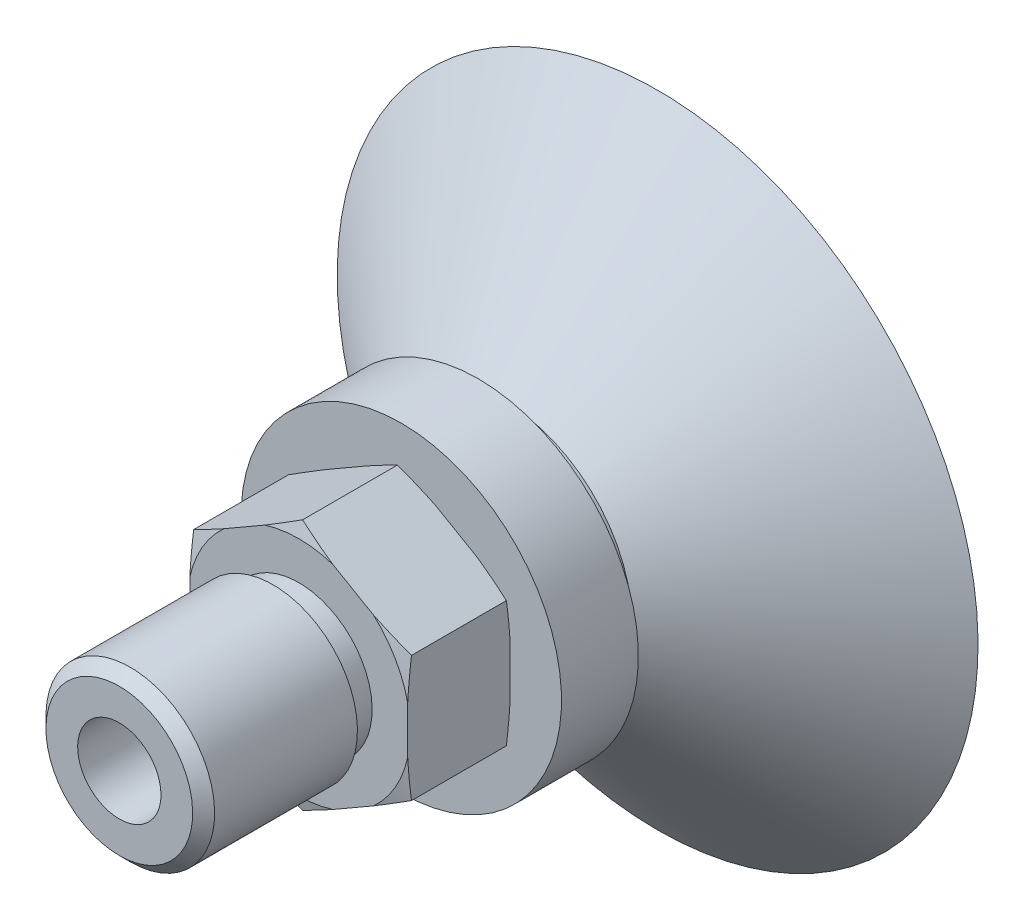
ISO-10303-21;
HEADER;
FILE_DESCRIPTION(('STEP AP214'),'2;1');
FILE_NAME('part.step','',(''),(''),'','','');
FILE_SCHEMA(('AUTOMOTIVE_DESIGN { 1 0 10303 214 1 1 1 1 }'));
ENDSEC;
DATA;
#1=APPLICATION_CONTEXT('core data for automotive mechanical design processes');
#2=APPLICATION_PROTOCOL_DEFINITION('international standard','automotive_design',2000,#1);
#3=PRODUCT_CONTEXT('',#1,'mechanical');
#4=PRODUCT('Part','Part','',(#3));
#5=PRODUCT_RELATED_PRODUCT_CATEGORY('part','',(#4));
#6=PRODUCT_DEFINITION_FORMATION('','',#4);
#7=PRODUCT_DEFINITION_CONTEXT('part definition',#1,'design');
#8=PRODUCT_DEFINITION('design','',#6,#7);
#9=PRODUCT_DEFINITION_SHAPE('','',#8);
#10=(LENGTH_UNIT() NAMED_UNIT(*) SI_UNIT(.MILLI.,.METRE.));
#11=(NAMED_UNIT(*) PLANE_ANGLE_UNIT() SI_UNIT($,.RADIAN.));
#12=(NAMED_UNIT(*) SI_UNIT($,.STERADIAN.) SOLID_ANGLE_UNIT());
#13=UNCERTAINTY_MEASURE_WITH_UNIT(LENGTH_MEASURE(1.E-05),#10,'distance_accuracy_value','');
#14=(GEOMETRIC_REPRESENTATION_CONTEXT(3) GLOBAL_UNCERTAINTY_ASSIGNED_CONTEXT((#13)) GLOBAL_UNIT_ASSIGNED_CONTEXT((#10,
#11,#12)) REPRESENTATION_CONTEXT('',''));
#15=CARTESIAN_POINT('',(0.,0.,0.));
#16=DIRECTION('',(0.,0.,1.));
#17=DIRECTION('',(1.,0.,0.));
#18=AXIS2_PLACEMENT_3D('',#15,#16,#17);
#19=CARTESIAN_POINT('',(0.,0.,28.));
#20=DIRECTION('',(0.,0.,-1.));
#21=DIRECTION('',(0.,-1.,0.));
#22=AXIS2_PLACEMENT_3D('',#19,#20,#21);
#23=PLANE('',#22);
#24=CARTESIAN_POINT('',(0.,0.,28.));
#25=DIRECTION('',(0.,0.,-1.));
#26=DIRECTION('',(0.,-1.,0.));
#27=AXIS2_PLACEMENT_3D('',#24,#25,#26);
#28=CIRCLE('',#27,5.725);
#29=CARTESIAN_POINT('',(0.,-5.725,28.));
#30=VERTEX_POINT('',#29);
#31=EDGE_CURVE('E393',#30,#30,#28,.T.);
#32=ORIENTED_EDGE('',*,*,#31,.T.);
#33=EDGE_LOOP('',(#32));
#34=FACE_BOUND('',#33,.T.);
#35=DIRECTION('',(0.,-1.,0.));
#36=VECTOR('',#35,1.);
#37=CARTESIAN_POINT('',(-8.5,4.90747728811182,28.));
#38=LINE('',#37,#36);
#39=CARTESIAN_POINT('',(-8.5,1.83273733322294,28.));
#40=VERTEX_POINT('',#39);
#41=CARTESIAN_POINT('',(-8.5,-1.83273733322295,28.));
#42=VERTEX_POINT('',#41);
#43=EDGE_CURVE('E1793',#40,#42,#38,.T.);
#44=ORIENTED_EDGE('',*,*,#43,.T.);
#45=CARTESIAN_POINT('',(0.,0.,28.));
#46=DIRECTION('',(0.,0.,-1.));
#47=DIRECTION('',(-1.,0.,0.));
#48=AXIS2_PLACEMENT_3D('',#45,#46,#47);
#49=CIRCLE('',#48,8.69533933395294);
#50=CARTESIAN_POINT('',(-5.83719708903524,-6.44484726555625,28.));
#51=VERTEX_POINT('',#50);
#52=EDGE_CURVE('E1790',#42,#51,#49,.F.);
#53=ORIENTED_EDGE('',*,*,#52,.T.);
#54=DIRECTION('',(0.866025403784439,-0.5,0.));
#55=VECTOR('',#54,1.);
#56=CARTESIAN_POINT('',(-8.5,-4.90747728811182,28.));
#57=LINE('',#56,#55);
#58=CARTESIAN_POINT('',(-2.66280291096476,-8.27758459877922,28.));
#59=VERTEX_POINT('',#58);
#60=EDGE_CURVE('E1782',#51,#59,#57,.T.);
#61=ORIENTED_EDGE('',*,*,#60,.T.);
#62=CARTESIAN_POINT('',(2.66280291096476,-8.27758459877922,28.));
#63=VERTEX_POINT('',#62);
#64=EDGE_CURVE('E1789',#59,#63,#49,.F.);
#65=ORIENTED_EDGE('',*,*,#64,.T.);
#66=DIRECTION('',(0.866025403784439,0.5,0.));
#67=VECTOR('',#66,1.);
#68=CARTESIAN_POINT('',(0.,-9.81495457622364,28.));
#69=LINE('',#68,#67);
#70=CARTESIAN_POINT('',(5.83719708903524,-6.44484726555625,28.));
#71=VERTEX_POINT('',#70);
#72=EDGE_CURVE('E1792',#63,#71,#69,.T.);
#73=ORIENTED_EDGE('',*,*,#72,.T.);
#74=CARTESIAN_POINT('',(8.5,-1.83273733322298,28.));
#75=VERTEX_POINT('',#74);
#76=EDGE_CURVE('E1871',#71,#75,#49,.F.);
#77=ORIENTED_EDGE('',*,*,#76,.T.);
#78=DIRECTION('',(0.,1.,0.));
#79=VECTOR('',#78,1.);
#80=CARTESIAN_POINT('',(8.5,-4.90747728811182,28.));
#81=LINE('',#80,#79);
#82=CARTESIAN_POINT('',(8.5,1.83273733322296,28.));
#83=VERTEX_POINT('',#82);
#84=EDGE_CURVE('E1797',#75,#83,#81,.T.);
#85=ORIENTED_EDGE('',*,*,#84,.T.);
#86=CARTESIAN_POINT('',(5.83719708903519,6.44484726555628,28.));
#87=VERTEX_POINT('',#86);
#88=EDGE_CURVE('E1950',#83,#87,#49,.F.);
#89=ORIENTED_EDGE('',*,*,#88,.T.);
#90=DIRECTION('',(-0.866025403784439,0.5,0.));
#91=VECTOR('',#90,1.);
#92=CARTESIAN_POINT('',(8.5,4.90747728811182,28.));
#93=LINE('',#92,#91);
#94=CARTESIAN_POINT('',(2.66280291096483,8.27758459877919,28.));
#95=VERTEX_POINT('',#94);
#96=EDGE_CURVE('E1826',#87,#95,#93,.T.);
#97=ORIENTED_EDGE('',*,*,#96,.T.);
#98=CARTESIAN_POINT('',(-2.66280291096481,8.27758459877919,28.));
#99=VERTEX_POINT('',#98);
#100=EDGE_CURVE('E345',#95,#99,#49,.F.);
#101=ORIENTED_EDGE('',*,*,#100,.T.);
#102=DIRECTION('',(-0.866025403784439,-0.5,0.));
#103=VECTOR('',#102,1.);
#104=CARTESIAN_POINT('',(0.,9.81495457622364,28.));
#105=LINE('',#104,#103);
#106=CARTESIAN_POINT('',(-5.8371970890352,6.44484726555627,28.));
#107=VERTEX_POINT('',#106);
#108=EDGE_CURVE('E363',#99,#107,#105,.T.);
#109=ORIENTED_EDGE('',*,*,#108,.T.);
#110=EDGE_CURVE('E589',#107,#40,#49,.F.);
#111=ORIENTED_EDGE('',*,*,#110,.T.);
#112=EDGE_LOOP('',(#44,#53,#61,#65,#73,#77,#85,#89,#97,#101,#109,#111));
#113=FACE_BOUND('',#112,.T.);
#114=ADVANCED_FACE('F16',(#34,#113),#23,.F.);
#115=CARTESIAN_POINT('',(-12.5,0.,20.));
#116=DIRECTION('',(0.,0.,1.));
#117=DIRECTION('',(-1.,0.,0.));
#118=AXIS2_PLACEMENT_3D('',#115,#116,#117);
#119=PLANE('',#118);
#120=CARTESIAN_POINT('',(0.,0.,20.));
#121=DIRECTION('',(0.,0.,-1.));
#122=DIRECTION('',(0.,1.,0.));
#123=AXIS2_PLACEMENT_3D('',#120,#121,#122);
#124=CIRCLE('',#123,8.69533933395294);
#125=CARTESIAN_POINT('',(5.8371970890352,6.44484726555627,20.));
#126=VERTEX_POINT('',#125);
#127=CARTESIAN_POINT('',(8.5,1.83273733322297,20.));
#128=VERTEX_POINT('',#127);
#129=EDGE_CURVE('E1008',#126,#128,#124,.T.);
#130=ORIENTED_EDGE('',*,*,#129,.T.);
#131=DIRECTION('',(0.,1.,0.));
#132=VECTOR('',#131,1.);
#133=CARTESIAN_POINT('',(8.5,-4.90747728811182,20.));
#134=LINE('',#133,#132);
#135=CARTESIAN_POINT('',(8.5,-1.83273733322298,20.));
#136=VERTEX_POINT('',#135);
#137=EDGE_CURVE('E1823',#136,#128,#134,.T.);
#138=ORIENTED_EDGE('',*,*,#137,.F.);
#139=CARTESIAN_POINT('',(5.83719708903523,-6.44484726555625,20.));
#140=VERTEX_POINT('',#139);
#141=EDGE_CURVE('E1005',#136,#140,#124,.T.);
#142=ORIENTED_EDGE('',*,*,#141,.T.);
#143=DIRECTION('',(0.866025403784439,0.5,0.));
#144=VECTOR('',#143,1.);
#145=CARTESIAN_POINT('',(0.,-9.81495457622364,20.));
#146=LINE('',#145,#144);
#147=CARTESIAN_POINT('',(2.66280291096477,-8.27758459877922,20.));
#148=VERTEX_POINT('',#147);
#149=EDGE_CURVE('E1819',#148,#140,#146,.T.);
#150=ORIENTED_EDGE('',*,*,#149,.F.);
#151=CARTESIAN_POINT('',(-2.66280291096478,-8.27758459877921,20.));
#152=VERTEX_POINT('',#151);
#153=EDGE_CURVE('E1009',#148,#152,#124,.T.);
#154=ORIENTED_EDGE('',*,*,#153,.T.);
#155=DIRECTION('',(0.866025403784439,-0.5,0.));
#156=VECTOR('',#155,1.);
#157=CARTESIAN_POINT('',(-8.5,-4.90747728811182,20.));
#158=LINE('',#157,#156);
#159=CARTESIAN_POINT('',(-5.83719708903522,-6.44484726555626,20.));
#160=VERTEX_POINT('',#159);
#161=EDGE_CURVE('E1816',#160,#152,#158,.T.);
#162=ORIENTED_EDGE('',*,*,#161,.F.);
#163=CARTESIAN_POINT('',(-8.5,-1.83273733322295,20.));
#164=VERTEX_POINT('',#163);
#165=EDGE_CURVE('E1867',#160,#164,#124,.T.);
#166=ORIENTED_EDGE('',*,*,#165,.T.);
#167=DIRECTION('',(0.,-1.,0.));
#168=VECTOR('',#167,1.);
#169=CARTESIAN_POINT('',(-8.5,4.90747728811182,20.));
#170=LINE('',#169,#168);
#171=CARTESIAN_POINT('',(-8.5,1.83273733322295,20.));
#172=VERTEX_POINT('',#171);
#173=EDGE_CURVE('E1813',#172,#164,#170,.T.);
#174=ORIENTED_EDGE('',*,*,#173,.F.);
#175=CARTESIAN_POINT('',(-5.83719708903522,6.44484726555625,20.));
#176=VERTEX_POINT('',#175);
#177=EDGE_CURVE('E1869',#172,#176,#124,.T.);
#178=ORIENTED_EDGE('',*,*,#177,.T.);
#179=DIRECTION('',(-0.866025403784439,-0.5,0.));
#180=VECTOR('',#179,1.);
#181=CARTESIAN_POINT('',(0.,9.81495457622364,20.));
#182=LINE('',#181,#180);
#183=CARTESIAN_POINT('',(-2.66280291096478,8.2775845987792,20.));
#184=VERTEX_POINT('',#183);
#185=EDGE_CURVE('E1809',#184,#176,#182,.T.);
#186=ORIENTED_EDGE('',*,*,#185,.F.);
#187=CARTESIAN_POINT('',(2.6628029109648,8.2775845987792,20.));
#188=VERTEX_POINT('',#187);
#189=EDGE_CURVE('E1910',#184,#188,#124,.T.);
#190=ORIENTED_EDGE('',*,*,#189,.T.);
#191=DIRECTION('',(-0.866025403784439,0.5,0.));
#192=VECTOR('',#191,1.);
#193=CARTESIAN_POINT('',(8.5,4.90747728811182,20.));
#194=LINE('',#193,#192);
#195=EDGE_CURVE('E1806',#126,#188,#194,.T.);
#196=ORIENTED_EDGE('',*,*,#195,.F.);
#197=EDGE_LOOP('',(#130,#138,#142,#150,#154,#162,#166,#174,#178,#186,#190,#196));
#198=FACE_BOUND('',#197,.T.);
#199=CARTESIAN_POINT('',(0.,0.,20.));
#200=DIRECTION('',(0.,0.,-1.));
#201=DIRECTION('',(0.,-1.,0.));
#202=AXIS2_PLACEMENT_3D('',#199,#200,#201);
#203=CIRCLE('',#202,12.5);
#204=CARTESIAN_POINT('',(0.,-12.5,20.));
#205=VERTEX_POINT('',#204);
#206=EDGE_CURVE('E398',#205,#205,#203,.T.);
#207=ORIENTED_EDGE('',*,*,#206,.F.);
#208=EDGE_LOOP('',(#207));
#209=FACE_BOUND('',#208,.T.);
#210=ADVANCED_FACE('F506',(#198,#209),#119,.T.);
#211=CARTESIAN_POINT('',(-0.675,1.16913429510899,0.));
#212=DIRECTION('',(0.5,-0.866025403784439,0.));
#213=DIRECTION('',(0.866025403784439,0.5,0.));
#214=AXIS2_PLACEMENT_3D('',#211,#212,#213);
#215=PLANE('',#214);
#216=CARTESIAN_POINT('',(15.1590284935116,10.3109149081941,3.));
#217=CARTESIAN_POINT('',(14.6969648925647,10.0441742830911,3.23943305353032));
#218=CARTESIAN_POINT('',(14.2348509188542,9.77748010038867,3.47882069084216));
#219=CARTESIAN_POINT('',(13.3473771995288,9.26528088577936,3.93841679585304));
#220=CARTESIAN_POINT('',(12.9220204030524,9.01977933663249,4.15863484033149));
#221=CARTESIAN_POINT('',(12.1081192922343,8.54987424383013,4.57989276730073));
#222=CARTESIAN_POINT('',(11.7195736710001,8.32548282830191,4.78094365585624));
#223=CARTESIAN_POINT('',(10.9792967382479,7.89778842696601,5.16386898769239));
#224=CARTESIAN_POINT('',(10.6275634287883,7.69450061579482,5.34575649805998));
#225=CARTESIAN_POINT('',(9.78292914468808,7.20705398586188,5.78210848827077));
#226=CARTESIAN_POINT('',(9.28986986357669,6.92309114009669,6.03648540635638));
#227=CARTESIAN_POINT('',(8.36067582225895,6.38795305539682,6.51530220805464));
#228=CARTESIAN_POINT('',(7.92456247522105,6.1367897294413,6.73979692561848));
#229=CARTESIAN_POINT('',(7.10984185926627,5.66635805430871,7.15887270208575));
#230=CARTESIAN_POINT('',(6.73118979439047,5.44722428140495,7.35351767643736));
#231=CARTESIAN_POINT('',(6.03080375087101,5.04172520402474,7.71281043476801));
#232=CARTESIAN_POINT('',(5.70909615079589,4.8554009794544,7.87755602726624));
#233=CARTESIAN_POINT('',(5.38717782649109,4.66913429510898,8.04195445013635));
#234=B_SPLINE_CURVE_WITH_KNOTS('',3,(#216,#217,#218,#219,#220,#221,#222,#223,#224,#225,#226,
#227,#228,#229,#230,#231,#232,#233),.UNSPECIFIED.,.F.,.F.,(4,2,2,2,2,2,2,2,4),(0.,
1.75437562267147,3.36907637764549,4.84409028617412,6.17942819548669,8.04920041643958,
9.70240322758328,11.1389095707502,12.3588199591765),.UNSPECIFIED.);
#235=CARTESIAN_POINT('',(15.1590284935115,10.310914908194,3.));
#236=VERTEX_POINT('',#235);
#237=CARTESIAN_POINT('',(5.38717782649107,4.66913429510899,8.04195445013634));
#238=VERTEX_POINT('',#237);
#239=EDGE_CURVE('E532',#236,#238,#234,.T.);
#240=ORIENTED_EDGE('',*,*,#239,.F.);
#241=DIRECTION('',(0.866025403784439,0.5,0.));
#242=VECTOR('',#241,1.);
#243=CARTESIAN_POINT('',(5.38717782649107,4.66913429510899,3.));
#244=LINE('',#243,#242);
#245=CARTESIAN_POINT('',(5.38717782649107,4.66913429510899,3.));
#246=VERTEX_POINT('',#245);
#247=EDGE_CURVE('E454',#246,#236,#244,.T.);
#248=ORIENTED_EDGE('',*,*,#247,.F.);
#249=DIRECTION('',(0.,0.,-1.));
#250=VECTOR('',#249,1.);
#251=CARTESIAN_POINT('',(5.38717782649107,4.66913429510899,10.));
#252=LINE('',#251,#250);
#253=EDGE_CURVE('E525',#238,#246,#252,.T.);
#254=ORIENTED_EDGE('',*,*,#253,.F.);
#255=EDGE_LOOP('',(#240,#248,#254));
#256=FACE_BOUND('',#255,.T.);
#257=ADVANCED_FACE('F501',(#256),#215,.F.);
#258=CARTESIAN_POINT('',(0.675,-1.16913429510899,0.));
#259=DIRECTION('',(0.5,-0.866025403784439,0.));
#260=DIRECTION('',(0.866025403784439,0.5,0.));
#261=AXIS2_PLACEMENT_3D('',#258,#259,#260);
#262=PLANE('',#261);
#263=DIRECTION('',(0.866025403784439,0.5,0.));
#264=VECTOR('',#263,1.);
#265=CARTESIAN_POINT('',(6.73717782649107,2.33086570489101,3.));
#266=LINE('',#265,#264);
#267=CARTESIAN_POINT('',(6.73717782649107,2.33086570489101,3.));
#268=VERTEX_POINT('',#267);
#269=CARTESIAN_POINT('',(16.5090284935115,7.97264631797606,3.));
#270=VERTEX_POINT('',#269);
#271=EDGE_CURVE('E455',#268,#270,#266,.T.);
#272=ORIENTED_EDGE('',*,*,#271,.T.);
#273=CARTESIAN_POINT('',(16.5090284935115,7.97264631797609,3.));
#274=CARTESIAN_POINT('',(9.47311930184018,3.91046225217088,6.64604028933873));
#275=CARTESIAN_POINT('',(6.73717782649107,2.33086570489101,8.04195445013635));
#276=B_SPLINE_CURVE_WITH_KNOTS('',2,(#273,#274,#275),.UNSPECIFIED.,.F.,.F.,(3,3),(0.,1.),.UNSPECIFIED.);
#277=CARTESIAN_POINT('',(6.73717782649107,2.33086570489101,8.04195445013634));
#278=VERTEX_POINT('',#277);
#279=EDGE_CURVE('E389',#270,#278,#276,.T.);
#280=ORIENTED_EDGE('',*,*,#279,.T.);
#281=DIRECTION('',(0.,0.,-1.));
#282=VECTOR('',#281,1.);
#283=CARTESIAN_POINT('',(6.73717782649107,2.33086570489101,10.));
#284=LINE('',#283,#282);
#285=EDGE_CURVE('E584',#278,#268,#284,.T.);
#286=ORIENTED_EDGE('',*,*,#285,.T.);
#287=EDGE_LOOP('',(#272,#280,#286));
#288=FACE_BOUND('',#287,.T.);
#289=ADVANCED_FACE('F505',(#288),#262,.T.);
#290=CARTESIAN_POINT('',(6.73717782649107,2.33086570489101,10.));
#291=DIRECTION('',(0.866025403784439,0.5,0.));
#292=DIRECTION('',(0.,0.,1.));
#293=AXIS2_PLACEMENT_3D('',#290,#291,#292);
#294=PLANE('',#293);
#295=CARTESIAN_POINT('',(5.38717782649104,4.66913429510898,8.04195445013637));
#296=CARTESIAN_POINT('',(5.44356780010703,4.57144442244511,8.05157400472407));
#297=CARTESIAN_POINT('',(5.50000208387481,4.47366443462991,8.0600374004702));
#298=CARTESIAN_POINT('',(5.61258941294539,4.27862581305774,8.07453367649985));
#299=CARTESIAN_POINT('',(5.66874185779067,4.18136799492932,8.08058222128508));
#300=CARTESIAN_POINT('',(5.78104007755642,3.98695717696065,8.09025068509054));
#301=CARTESIAN_POINT('',(5.83718568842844,3.88980429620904,8.09387488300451));
#302=CARTESIAN_POINT('',(5.94968438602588,3.69514201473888,8.09870903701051));
#303=CARTESIAN_POINT('',(6.00603755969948,3.5976324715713,8.09991119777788));
#304=CARTESIAN_POINT('',(6.11865402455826,3.40257173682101,8.09991193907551));
#305=CARTESIAN_POINT('',(6.17491732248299,3.30502054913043,8.09871070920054));
#306=CARTESIAN_POINT('',(6.28724342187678,3.11027240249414,8.09387774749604));
#307=CARTESIAN_POINT('',(6.3433062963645,3.01307529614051,8.09025368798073));
#308=CARTESIAN_POINT('',(6.45552289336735,2.8186175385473,8.08058517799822));
#309=CARTESIAN_POINT('',(6.51167659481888,2.7213570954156,8.07453631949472));
#310=CARTESIAN_POINT('',(6.62429852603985,2.52632465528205,8.06003902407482));
#311=CARTESIAN_POINT('',(6.68076634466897,2.42855359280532,8.05157479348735));
#312=CARTESIAN_POINT('',(6.73717782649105,2.330865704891,8.04195445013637));
#313=B_SPLINE_CURVE_WITH_KNOTS('',3,(#295,#296,#297,#298,#299,#300,#301,#302,#303,#304,#305,
#306,#307,#308,#309,#310,#311,#312),.UNSPECIFIED.,.F.,.F.,(4,2,2,2,2,2,2,2,4),(0.,
0.339615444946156,0.676990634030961,1.01376878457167,1.35162913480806,1.68946283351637,
2.0262317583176,2.36361569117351,2.70325835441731),.UNSPECIFIED.);
#314=EDGE_CURVE('E714',#238,#278,#313,.T.);
#315=ORIENTED_EDGE('',*,*,#314,.F.);
#316=ORIENTED_EDGE('',*,*,#253,.T.);
#317=DIRECTION('',(-0.5,0.866025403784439,0.));
#318=VECTOR('',#317,1.);
#319=CARTESIAN_POINT('',(6.73717782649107,2.33086570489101,3.));
#320=LINE('',#319,#318);
#321=EDGE_CURVE('E450',#268,#246,#320,.T.);
#322=ORIENTED_EDGE('',*,*,#321,.F.);
#323=ORIENTED_EDGE('',*,*,#285,.F.);
#324=EDGE_LOOP('',(#315,#316,#322,#323));
#325=FACE_BOUND('',#324,.T.);
#326=ADVANCED_FACE('F553',(#325),#294,.F.);
#327=CARTESIAN_POINT('',(6.73717782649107,2.33086570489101,3.));
#328=DIRECTION('',(0.,0.,1.));
#329=DIRECTION('',(-1.,0.,0.));
#330=AXIS2_PLACEMENT_3D('',#327,#328,#329);
#331=PLANE('',#330);
#332=CARTESIAN_POINT('',(0.,0.,3.));
#333=DIRECTION('',(0.,0.,1.));
#334=DIRECTION('',(0.,1.,0.));
#335=AXIS2_PLACEMENT_3D('',#332,#333,#334);
#336=CIRCLE('',#335,18.3333333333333);
#337=EDGE_CURVE('E528',#270,#236,#336,.T.);
#338=ORIENTED_EDGE('',*,*,#337,.F.);
#339=ORIENTED_EDGE('',*,*,#271,.F.);
#340=ORIENTED_EDGE('',*,*,#321,.T.);
#341=ORIENTED_EDGE('',*,*,#247,.T.);
#342=EDGE_LOOP('',(#338,#339,#340,#341));
#343=FACE_BOUND('',#342,.T.);
#344=ADVANCED_FACE('F491',(#343),#331,.F.);
#345=CARTESIAN_POINT('',(-0.675,1.16913429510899,0.));
#346=DIRECTION('',(-0.5,0.866025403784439,0.));
#347=DIRECTION('',(0.,0.,-1.));
#348=AXIS2_PLACEMENT_3D('',#345,#346,#347);
#349=PLANE('',#348);
#350=DIRECTION('',(0.866025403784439,0.5,0.));
#351=VECTOR('',#350,1.);
#352=CARTESIAN_POINT('',(-17.1294826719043,-8.330865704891,3.));
#353=LINE('',#352,#351);
#354=CARTESIAN_POINT('',(-16.5090284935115,-7.97264631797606,3.));
#355=VERTEX_POINT('',#354);
#356=CARTESIAN_POINT('',(-6.73717782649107,-2.33086570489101,3.));
#357=VERTEX_POINT('',#356);
#358=EDGE_CURVE('E417',#355,#357,#353,.T.);
#359=ORIENTED_EDGE('',*,*,#358,.F.);
#360=CARTESIAN_POINT('',(-16.5090284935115,-7.97264631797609,3.));
#361=CARTESIAN_POINT('',(-9.47311930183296,-3.91046225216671,6.64604028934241));
#362=CARTESIAN_POINT('',(-6.73717782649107,-2.33086570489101,8.04195445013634));
#363=B_SPLINE_CURVE_WITH_KNOTS('',2,(#360,#361,#362),.UNSPECIFIED.,.F.,.F.,(3,3),(0.,1.),.UNSPECIFIED.);
#364=CARTESIAN_POINT('',(-6.73717782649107,-2.33086570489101,8.04195445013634));
#365=VERTEX_POINT('',#364);
#366=EDGE_CURVE('E433',#355,#365,#363,.T.);
#367=ORIENTED_EDGE('',*,*,#366,.T.);
#368=DIRECTION('',(0.,0.,1.));
#369=VECTOR('',#368,1.);
#370=CARTESIAN_POINT('',(-6.73717782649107,-2.33086570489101,3.));
#371=LINE('',#370,#369);
#372=EDGE_CURVE('E1027',#357,#365,#371,.T.);
#373=ORIENTED_EDGE('',*,*,#372,.F.);
#374=EDGE_LOOP('',(#359,#367,#373));
#375=FACE_BOUND('',#374,.T.);
#376=ADVANCED_FACE('F480',(#375),#349,.T.);
#377=CARTESIAN_POINT('',(0.675,-1.16913429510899,0.));
#378=DIRECTION('',(-0.5,0.866025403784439,0.));
#379=DIRECTION('',(0.,0.,-1.));
#380=AXIS2_PLACEMENT_3D('',#377,#378,#379);
#381=PLANE('',#380);
#382=CARTESIAN_POINT('',(-15.1590284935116,-10.3109149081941,3.));
#383=CARTESIAN_POINT('',(-14.6969648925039,-10.0441742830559,3.23943305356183));
#384=CARTESIAN_POINT('',(-14.2348509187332,-9.77748010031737,3.4788206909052));
#385=CARTESIAN_POINT('',(-13.3473771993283,-9.26528088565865,3.93841679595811));
#386=CARTESIAN_POINT('',(-12.9220204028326,-9.01977933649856,4.15863484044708));
#387=CARTESIAN_POINT('',(-12.1081192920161,-8.54987424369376,4.57989276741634));
#388=CARTESIAN_POINT('',(-11.7195736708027,-8.32548282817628,4.78094365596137));
#389=CARTESIAN_POINT('',(-10.9792967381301,-7.89778842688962,5.16386898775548));
#390=CARTESIAN_POINT('',(-10.6275634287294,-7.69450061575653,5.34575649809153));
#391=CARTESIAN_POINT('',(-9.7829291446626,-7.20705398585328,5.78210848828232));
#392=CARTESIAN_POINT('',(-9.28986986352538,-6.92309114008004,6.03648540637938));
#393=CARTESIAN_POINT('',(-8.3606758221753,-6.38795305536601,6.51530220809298));
#394=CARTESIAN_POINT('',(-7.92456247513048,-6.13678972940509,6.73979692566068));
#395=CARTESIAN_POINT('',(-7.10984185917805,-5.66635805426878,7.15887270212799));
#396=CARTESIAN_POINT('',(-6.73118979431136,-5.44722428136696,7.35351767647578));
#397=CARTESIAN_POINT('',(-6.03080375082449,-5.04172520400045,7.71281043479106));
#398=CARTESIAN_POINT('',(-5.70909615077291,-4.85540097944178,7.87755602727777));
#399=CARTESIAN_POINT('',(-5.38717782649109,-4.66913429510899,8.04195445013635));
#400=B_SPLINE_CURVE_WITH_KNOTS('',3,(#382,#383,#384,#385,#386,#387,#388,#389,#390,#391,#392,
#393,#394,#395,#396,#397,#398,#399),.UNSPECIFIED.,.F.,.F.,(4,2,2,2,2,2,2,2,4),(0.,
1.75437562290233,3.36907637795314,4.84409028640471,6.17942819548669,8.04920041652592,
9.70240322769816,11.1389095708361,12.3588199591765),.UNSPECIFIED.);
#401=CARTESIAN_POINT('',(-15.1590284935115,-10.310914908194,3.));
#402=VERTEX_POINT('',#401);
#403=CARTESIAN_POINT('',(-5.38717782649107,-4.66913429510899,8.04195445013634));
#404=VERTEX_POINT('',#403);
#405=EDGE_CURVE('E1061',#402,#404,#400,.T.);
#406=ORIENTED_EDGE('',*,*,#405,.F.);
#407=DIRECTION('',(0.866025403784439,0.5,0.));
#408=VECTOR('',#407,1.);
#409=CARTESIAN_POINT('',(-15.7794826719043,-10.669134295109,3.));
#410=LINE('',#409,#408);
#411=CARTESIAN_POINT('',(-5.38717782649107,-4.66913429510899,3.));
#412=VERTEX_POINT('',#411);
#413=EDGE_CURVE('E416',#402,#412,#410,.T.);
#414=ORIENTED_EDGE('',*,*,#413,.T.);
#415=DIRECTION('',(0.,0.,1.));
#416=VECTOR('',#415,1.);
#417=CARTESIAN_POINT('',(-5.38717782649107,-4.66913429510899,3.));
#418=LINE('',#417,#416);
#419=EDGE_CURVE('E909',#412,#404,#418,.T.);
#420=ORIENTED_EDGE('',*,*,#419,.T.);
#421=EDGE_LOOP('',(#406,#414,#420));
#422=FACE_BOUND('',#421,.T.);
#423=ADVANCED_FACE('F490',(#422),#381,.F.);
#424=CARTESIAN_POINT('',(-5.38717782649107,-4.66913429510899,3.));
#425=DIRECTION('',(-0.866025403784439,-0.5,0.));
#426=DIRECTION('',(0.,0.,-1.));
#427=AXIS2_PLACEMENT_3D('',#424,#425,#426);
#428=PLANE('',#427);
#429=CARTESIAN_POINT('',(-5.38717782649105,-4.66913429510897,8.04195445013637));
#430=CARTESIAN_POINT('',(-5.44356780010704,-4.5714444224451,8.05157400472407));
#431=CARTESIAN_POINT('',(-5.50000208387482,-4.4736644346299,8.0600374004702));
#432=CARTESIAN_POINT('',(-5.6125894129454,-4.27862581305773,8.07453367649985));
#433=CARTESIAN_POINT('',(-5.66874185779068,-4.18136799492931,8.08058222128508));
#434=CARTESIAN_POINT('',(-5.78104007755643,-3.98695717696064,8.09025068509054));
#435=CARTESIAN_POINT('',(-5.83718568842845,-3.88980429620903,8.09387488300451));
#436=CARTESIAN_POINT('',(-5.94968438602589,-3.69514201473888,8.09870903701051));
#437=CARTESIAN_POINT('',(-6.00603755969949,-3.59763247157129,8.09991119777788));
#438=CARTESIAN_POINT('',(-6.11865402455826,-3.402571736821,8.09991193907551));
#439=CARTESIAN_POINT('',(-6.174917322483,-3.30502054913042,8.09871070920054));
#440=CARTESIAN_POINT('',(-6.28724342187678,-3.11027240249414,8.09387774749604));
#441=CARTESIAN_POINT('',(-6.3433062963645,-3.0130752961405,8.09025368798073));
#442=CARTESIAN_POINT('',(-6.45552289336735,-2.8186175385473,8.08058517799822));
#443=CARTESIAN_POINT('',(-6.51167659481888,-2.7213570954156,8.07453631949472));
#444=CARTESIAN_POINT('',(-6.62429852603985,-2.52632465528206,8.06003902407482));
#445=CARTESIAN_POINT('',(-6.68076634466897,-2.42855359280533,8.05157479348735));
#446=CARTESIAN_POINT('',(-6.73717782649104,-2.330865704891,8.04195445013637));
#447=B_SPLINE_CURVE_WITH_KNOTS('',3,(#429,#430,#431,#432,#433,#434,#435,#436,#437,#438,#439,
#440,#441,#442,#443,#444,#445,#446),.UNSPECIFIED.,.F.,.F.,(4,2,2,2,2,2,2,2,4),(0.,
0.339615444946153,0.676990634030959,1.01376878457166,1.35162913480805,1.68946283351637,
2.02623175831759,2.36361569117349,2.70325835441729),.UNSPECIFIED.);
#448=EDGE_CURVE('E1065',#404,#365,#447,.T.);
#449=ORIENTED_EDGE('',*,*,#448,.F.);
#450=ORIENTED_EDGE('',*,*,#419,.F.);
#451=DIRECTION('',(-0.5,0.866025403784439,0.));
#452=VECTOR('',#451,1.);
#453=CARTESIAN_POINT('',(-5.38717782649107,-4.66913429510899,3.));
#454=LINE('',#453,#452);
#455=EDGE_CURVE('E412',#412,#357,#454,.T.);
#456=ORIENTED_EDGE('',*,*,#455,.T.);
#457=ORIENTED_EDGE('',*,*,#372,.T.);
#458=EDGE_LOOP('',(#449,#450,#456,#457));
#459=FACE_BOUND('',#458,.T.);
#460=ADVANCED_FACE('F611',(#459),#428,.F.);
#461=CARTESIAN_POINT('',(-15.7794826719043,-10.669134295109,3.));
#462=DIRECTION('',(0.,0.,1.));
#463=DIRECTION('',(-1.,0.,0.));
#464=AXIS2_PLACEMENT_3D('',#461,#462,#463);
#465=PLANE('',#464);
#466=CARTESIAN_POINT('',(0.,0.,3.));
#467=DIRECTION('',(0.,0.,1.));
#468=DIRECTION('',(0.,1.,0.));
#469=AXIS2_PLACEMENT_3D('',#466,#467,#468);
#470=CIRCLE('',#469,18.3333333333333);
#471=EDGE_CURVE('E755',#355,#402,#470,.T.);
#472=ORIENTED_EDGE('',*,*,#471,.F.);
#473=ORIENTED_EDGE('',*,*,#358,.T.);
#474=ORIENTED_EDGE('',*,*,#455,.F.);
#475=ORIENTED_EDGE('',*,*,#413,.F.);
#476=EDGE_LOOP('',(#472,#473,#474,#475));
#477=FACE_BOUND('',#476,.T.);
#478=ADVANCED_FACE('F1158',(#477),#465,.F.);
#479=CARTESIAN_POINT('',(0.675,1.16913429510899,0.));
#480=DIRECTION('',(-0.5,-0.866025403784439,0.));
#481=DIRECTION('',(0.,0.,-1.));
#482=AXIS2_PLACEMENT_3D('',#479,#480,#481);
#483=PLANE('',#482);
#484=CARTESIAN_POINT('',(16.5090284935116,-7.97264631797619,3.));
#485=CARTESIAN_POINT('',(16.0469925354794,-7.7058578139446,3.23943305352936));
#486=CARTESIAN_POINT('',(15.5849716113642,-7.43900246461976,3.47882069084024));
#487=CARTESIAN_POINT('',(14.697657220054,-6.92652728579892,3.93841679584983));
#488=CARTESIAN_POINT('',(14.2723682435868,-6.68090826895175,4.15863484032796));
#489=CARTESIAN_POINT('',(13.4584679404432,-6.21100177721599,4.5798927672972));
#490=CARTESIAN_POINT('',(13.0698664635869,-5.98670710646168,4.78094365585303));
#491=CARTESIAN_POINT('',(12.329333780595,-5.55945567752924,5.16386898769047));
#492=CARTESIAN_POINT('',(11.9774147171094,-5.35648960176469,5.34575649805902));
#493=CARTESIAN_POINT('',(11.1329564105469,-4.86873816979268,5.78210848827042));
#494=CARTESIAN_POINT('',(10.6405077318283,-4.58371772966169,6.03648540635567));
#495=CARTESIAN_POINT('',(9.71246753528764,-4.04658112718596,6.51530220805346));
#496=CARTESIAN_POINT('',(9.27689704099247,-3.79447755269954,6.73979692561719));
#497=CARTESIAN_POINT('',(8.46213095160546,-3.32412463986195,7.15887270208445));
#498=CARTESIAN_POINT('',(8.08302950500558,-3.10576921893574,7.35351767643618));
#499=CARTESIAN_POINT('',(7.38166398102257,-2.70196665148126,7.7128104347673));
#500=CARTESIAN_POINT('',(7.059448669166,-2.51652180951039,7.87755602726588));
#501=CARTESIAN_POINT('',(6.73717782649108,-2.33086570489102,8.04195445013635));
#502=B_SPLINE_CURVE_WITH_KNOTS('',3,(#484,#485,#486,#487,#488,#489,#490,#491,#492,#493,#494,
#495,#496,#497,#498,#499,#500,#501),.UNSPECIFIED.,.F.,.F.,(4,2,2,2,2,2,2,2,4),(0.,
1.75437562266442,3.36907637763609,4.84409028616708,6.17942819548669,8.04920041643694,
9.70240322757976,11.1389095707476,12.3588199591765),.UNSPECIFIED.);
#503=CARTESIAN_POINT('',(16.5090284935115,-7.97264631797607,3.));
#504=VERTEX_POINT('',#503);
#505=CARTESIAN_POINT('',(6.73717782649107,-2.33086570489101,8.04195445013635));
#506=VERTEX_POINT('',#505);
#507=EDGE_CURVE('E861',#504,#506,#502,.T.);
#508=ORIENTED_EDGE('',*,*,#507,.F.);
#509=DIRECTION('',(0.866025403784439,-0.5,0.));
#510=VECTOR('',#509,1.);
#511=CARTESIAN_POINT('',(6.73717782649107,-2.33086570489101,3.));
#512=LINE('',#511,#510);
#513=CARTESIAN_POINT('',(6.73717782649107,-2.33086570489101,3.));
#514=VERTEX_POINT('',#513);
#515=EDGE_CURVE('E426',#514,#504,#512,.T.);
#516=ORIENTED_EDGE('',*,*,#515,.F.);
#517=DIRECTION('',(0.,0.,-1.));
#518=VECTOR('',#517,1.);
#519=CARTESIAN_POINT('',(6.73717782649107,-2.33086570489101,10.));
#520=LINE('',#519,#518);
#521=EDGE_CURVE('E843',#506,#514,#520,.T.);
#522=ORIENTED_EDGE('',*,*,#521,.F.);
#523=EDGE_LOOP('',(#508,#516,#522));
#524=FACE_BOUND('',#523,.T.);
#525=ADVANCED_FACE('F890',(#524),#483,.F.);
#526=CARTESIAN_POINT('',(-0.675,-1.16913429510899,0.));
#527=DIRECTION('',(-0.5,-0.866025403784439,0.));
#528=DIRECTION('',(0.,0.,-1.));
#529=AXIS2_PLACEMENT_3D('',#526,#527,#528);
#530=PLANE('',#529);
#531=DIRECTION('',(0.866025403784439,-0.5,0.));
#532=VECTOR('',#531,1.);
#533=CARTESIAN_POINT('',(5.38717782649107,-4.66913429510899,3.));
#534=LINE('',#533,#532);
#535=CARTESIAN_POINT('',(5.38717782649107,-4.66913429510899,3.));
#536=VERTEX_POINT('',#535);
#537=CARTESIAN_POINT('',(15.1590284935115,-10.3109149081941,3.));
#538=VERTEX_POINT('',#537);
#539=EDGE_CURVE('E427',#536,#538,#534,.T.);
#540=ORIENTED_EDGE('',*,*,#539,.T.);
#541=CARTESIAN_POINT('',(15.1590284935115,-10.3109149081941,3.));
#542=CARTESIAN_POINT('',(8.12311930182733,-6.24873084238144,6.6460402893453));
#543=CARTESIAN_POINT('',(5.38717782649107,-4.66913429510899,8.04195445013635));
#544=B_SPLINE_CURVE_WITH_KNOTS('',2,(#541,#542,#543),.UNSPECIFIED.,.F.,.F.,(3,3),(0.,1.),.UNSPECIFIED.);
#545=CARTESIAN_POINT('',(5.38717782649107,-4.66913429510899,8.04195445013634));
#546=VERTEX_POINT('',#545);
#547=EDGE_CURVE('E869',#538,#546,#544,.T.);
#548=ORIENTED_EDGE('',*,*,#547,.T.);
#549=DIRECTION('',(0.,0.,-1.));
#550=VECTOR('',#549,1.);
#551=CARTESIAN_POINT('',(5.38717782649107,-4.66913429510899,10.));
#552=LINE('',#551,#550);
#553=EDGE_CURVE('E851',#546,#536,#552,.T.);
#554=ORIENTED_EDGE('',*,*,#553,.T.);
#555=EDGE_LOOP('',(#540,#548,#554));
#556=FACE_BOUND('',#555,.T.);
#557=ADVANCED_FACE('F834',(#556),#530,.T.);
#558=CARTESIAN_POINT('',(5.38717782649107,-4.66913429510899,10.));
#559=DIRECTION('',(0.866025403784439,-0.5,0.));
#560=DIRECTION('',(0.5,0.866025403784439,0.));
#561=AXIS2_PLACEMENT_3D('',#558,#559,#560);
#562=PLANE('',#561);
#563=CARTESIAN_POINT('',(6.73717782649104,-2.330865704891,8.04195445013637));
#564=CARTESIAN_POINT('',(6.68077090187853,-2.42854579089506,8.05157400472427));
#565=CARTESIAN_POINT('',(6.62430809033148,-2.5263093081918,8.0600374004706));
#566=CARTESIAN_POINT('',(6.51169335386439,-2.72133210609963,8.07453367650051));
#567=CARTESIAN_POINT('',(6.45554183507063,-2.81859045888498,8.08058222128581));
#568=CARTESIAN_POINT('',(6.34332623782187,-3.01304897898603,8.09025068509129));
#569=CARTESIAN_POINT('',(6.28726218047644,-3.11024894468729,8.09387488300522));
#570=CARTESIAN_POINT('',(6.17492904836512,-3.30500681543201,8.09870903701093));
#571=CARTESIAN_POINT('',(6.11865989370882,-3.40256486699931,8.09991119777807));
#572=CARTESIAN_POINT('',(6.00604057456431,-3.59762395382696,8.09991193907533));
#573=CARTESIAN_POINT('',(5.94969041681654,-3.69512499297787,8.09871070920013));
#574=CARTESIAN_POINT('',(5.83719662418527,-3.88977632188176,8.09387774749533));
#575=CARTESIAN_POINT('',(5.78105289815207,-3.98692674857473,8.09025368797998));
#576=CARTESIAN_POINT('',(5.66875583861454,-4.18133805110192,8.08058517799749));
#577=CARTESIAN_POINT('',(5.61260267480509,-4.27859880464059,8.07453631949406));
#578=CARTESIAN_POINT('',(5.50001059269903,-4.47364847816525,8.06003902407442));
#579=CARTESIAN_POINT('',(5.44357227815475,-4.57143657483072,8.05157479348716));
#580=CARTESIAN_POINT('',(5.38717782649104,-4.66913429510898,8.04195445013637));
#581=B_SPLINE_CURVE_WITH_KNOTS('',3,(#563,#564,#565,#566,#567,#568,#569,#570,#571,#572,#573,
#574,#575,#576,#577,#578,#579,#580),.UNSPECIFIED.,.F.,.F.,(4,2,2,2,2,2,2,2,4),(0.,
0.339615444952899,0.676990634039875,1.01376878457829,1.35162913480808,1.68946283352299,
2.0262317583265,2.36361569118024,2.70325835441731),.UNSPECIFIED.);
#582=EDGE_CURVE('E811',#506,#546,#581,.T.);
#583=ORIENTED_EDGE('',*,*,#582,.F.);
#584=ORIENTED_EDGE('',*,*,#521,.T.);
#585=DIRECTION('',(0.5,0.866025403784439,0.));
#586=VECTOR('',#585,1.);
#587=CARTESIAN_POINT('',(5.38717782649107,-4.66913429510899,3.));
#588=LINE('',#587,#586);
#589=EDGE_CURVE('E422',#536,#514,#588,.T.);
#590=ORIENTED_EDGE('',*,*,#589,.F.);
#591=ORIENTED_EDGE('',*,*,#553,.F.);
#592=EDGE_LOOP('',(#583,#584,#590,#591));
#593=FACE_BOUND('',#592,.T.);
#594=ADVANCED_FACE('F499',(#593),#562,.F.);
#595=CARTESIAN_POINT('',(5.38717782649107,-4.66913429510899,3.));
#596=DIRECTION('',(0.,0.,1.));
#597=DIRECTION('',(-1.,0.,0.));
#598=AXIS2_PLACEMENT_3D('',#595,#596,#597);
#599=PLANE('',#598);
#600=CARTESIAN_POINT('',(0.,0.,3.));
#601=DIRECTION('',(0.,0.,1.));
#602=DIRECTION('',(0.,1.,0.));
#603=AXIS2_PLACEMENT_3D('',#600,#601,#602);
#604=CIRCLE('',#603,18.3333333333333);
#605=EDGE_CURVE('E863',#538,#504,#604,.T.);
#606=ORIENTED_EDGE('',*,*,#605,.F.);
#607=ORIENTED_EDGE('',*,*,#539,.F.);
#608=ORIENTED_EDGE('',*,*,#589,.T.);
#609=ORIENTED_EDGE('',*,*,#515,.T.);
#610=EDGE_LOOP('',(#606,#607,#608,#609));
#611=FACE_BOUND('',#610,.T.);
#612=ADVANCED_FACE('F495',(#611),#599,.F.);
#613=CARTESIAN_POINT('',(0.675,1.16913429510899,0.));
#614=DIRECTION('',(0.5,0.866025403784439,0.));
#615=DIRECTION('',(0.,0.,1.));
#616=AXIS2_PLACEMENT_3D('',#613,#614,#615);
#617=PLANE('',#616);
#618=DIRECTION('',(0.866025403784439,-0.5,0.));
#619=VECTOR('',#618,1.);
#620=CARTESIAN_POINT('',(-15.7794826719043,10.669134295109,3.));
#621=LINE('',#620,#619);
#622=CARTESIAN_POINT('',(-15.1590284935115,10.310914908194,3.));
#623=VERTEX_POINT('',#622);
#624=CARTESIAN_POINT('',(-5.38717782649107,4.66913429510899,3.));
#625=VERTEX_POINT('',#624);
#626=EDGE_CURVE('E411',#623,#625,#621,.T.);
#627=ORIENTED_EDGE('',*,*,#626,.F.);
#628=CARTESIAN_POINT('',(-15.1590284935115,10.310914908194,3.));
#629=CARTESIAN_POINT('',(-8.123119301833,6.24873084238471,6.6460402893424));
#630=CARTESIAN_POINT('',(-5.38717782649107,4.66913429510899,8.04195445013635));
#631=B_SPLINE_CURVE_WITH_KNOTS('',2,(#628,#629,#630),.UNSPECIFIED.,.F.,.F.,(3,3),(0.,1.),.UNSPECIFIED.);
#632=CARTESIAN_POINT('',(-5.38717782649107,4.66913429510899,8.04195445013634));
#633=VERTEX_POINT('',#632);
#634=EDGE_CURVE('E748',#623,#633,#631,.T.);
#635=ORIENTED_EDGE('',*,*,#634,.T.);
#636=DIRECTION('',(0.,0.,1.));
#637=VECTOR('',#636,1.);
#638=CARTESIAN_POINT('',(-5.38717782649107,4.66913429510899,3.));
#639=LINE('',#638,#637);
#640=EDGE_CURVE('E717',#625,#633,#639,.T.);
#641=ORIENTED_EDGE('',*,*,#640,.F.);
#642=EDGE_LOOP('',(#627,#635,#641));
#643=FACE_BOUND('',#642,.T.);
#644=ADVANCED_FACE('F498',(#643),#617,.T.);
#645=CARTESIAN_POINT('',(-0.675,-1.16913429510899,0.));
#646=DIRECTION('',(0.5,0.866025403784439,0.));
#647=DIRECTION('',(0.,0.,1.));
#648=AXIS2_PLACEMENT_3D('',#645,#646,#647);
#649=PLANE('',#648);
#650=CARTESIAN_POINT('',(-16.5090284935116,7.97264631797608,3.));
#651=CARTESIAN_POINT('',(-16.046992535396,7.70585781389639,3.23943305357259));
#652=CARTESIAN_POINT('',(-15.5849716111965,7.43900246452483,3.47882069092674));
#653=CARTESIAN_POINT('',(-14.697657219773,6.92652728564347,3.93841679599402));
#654=CARTESIAN_POINT('',(-14.2723682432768,6.68090826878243,4.15863484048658));
#655=CARTESIAN_POINT('',(-13.4584679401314,6.2110017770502,4.57989276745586));
#656=CARTESIAN_POINT('',(-13.0698664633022,5.98670710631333,4.78094365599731));
#657=CARTESIAN_POINT('',(-12.3293337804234,5.55945567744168,5.16386898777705));
#658=CARTESIAN_POINT('',(-11.9774147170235,5.35648960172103,5.34575649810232));
#659=CARTESIAN_POINT('',(-11.1329564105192,4.86873816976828,5.78210848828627));
#660=CARTESIAN_POINT('',(-10.6405077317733,4.5837177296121,6.03648540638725));
#661=CARTESIAN_POINT('',(-9.71246753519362,4.04658112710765,6.51530220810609));
#662=CARTESIAN_POINT('',(-9.2768970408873,3.79447755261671,6.73979692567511));
#663=CARTESIAN_POINT('',(-8.46213095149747,3.32412463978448,7.15887270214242));
#664=CARTESIAN_POINT('',(-8.08302950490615,3.10576921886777,7.3535176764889));
#665=CARTESIAN_POINT('',(-7.38166398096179,2.70196665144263,7.71281043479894));
#666=CARTESIAN_POINT('',(-7.05944866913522,2.51652180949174,7.87755602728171));
#667=CARTESIAN_POINT('',(-6.73717782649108,2.330865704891,8.04195445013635));
#668=B_SPLINE_CURVE_WITH_KNOTS('',3,(#650,#651,#652,#653,#654,#655,#656,#657,#658,#659,#660,
#661,#662,#663,#664,#665,#666,#667),.UNSPECIFIED.,.F.,.F.,(4,2,2,2,2,2,2,2,4),(0.,
1.75437562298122,3.36907637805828,4.84409028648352,6.17942819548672,8.04920041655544,
9.70240322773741,11.1389095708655,12.3588199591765),.UNSPECIFIED.);
#669=CARTESIAN_POINT('',(-16.5090284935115,7.97264631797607,3.));
#670=VERTEX_POINT('',#669);
#671=CARTESIAN_POINT('',(-6.73717782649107,2.33086570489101,8.04195445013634));
#672=VERTEX_POINT('',#671);
#673=EDGE_CURVE('E751',#670,#672,#668,.T.);
#674=ORIENTED_EDGE('',*,*,#673,.F.);
#675=DIRECTION('',(0.866025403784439,-0.5,0.));
#676=VECTOR('',#675,1.);
#677=CARTESIAN_POINT('',(-17.1294826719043,8.33086570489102,3.));
#678=LINE('',#677,#676);
#679=CARTESIAN_POINT('',(-6.73717782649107,2.33086570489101,3.));
#680=VERTEX_POINT('',#679);
#681=EDGE_CURVE('E410',#670,#680,#678,.T.);
#682=ORIENTED_EDGE('',*,*,#681,.T.);
#683=DIRECTION('',(0.,0.,1.));
#684=VECTOR('',#683,1.);
#685=CARTESIAN_POINT('',(-6.73717782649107,2.33086570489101,3.));
#686=LINE('',#685,#684);
#687=EDGE_CURVE('E726',#680,#672,#686,.T.);
#688=ORIENTED_EDGE('',*,*,#687,.T.);
#689=EDGE_LOOP('',(#674,#682,#688));
#690=FACE_BOUND('',#689,.T.);
#691=ADVANCED_FACE('F836',(#690),#649,.F.);
#692=CARTESIAN_POINT('',(-6.73717782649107,2.33086570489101,3.));
#693=DIRECTION('',(-0.866025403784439,0.5,0.));
#694=DIRECTION('',(0.,0.,-1.));
#695=AXIS2_PLACEMENT_3D('',#692,#693,#694);
#696=PLANE('',#695);
#697=CARTESIAN_POINT('',(-6.73717782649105,2.33086570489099,8.04195445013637));
#698=CARTESIAN_POINT('',(-6.68077090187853,2.42854579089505,8.05157400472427));
#699=CARTESIAN_POINT('',(-6.62430809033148,2.52630930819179,8.0600374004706));
#700=CARTESIAN_POINT('',(-6.51169335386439,2.72133210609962,8.07453367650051));
#701=CARTESIAN_POINT('',(-6.45554183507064,2.81859045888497,8.08058222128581));
#702=CARTESIAN_POINT('',(-6.34332623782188,3.01304897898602,8.09025068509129));
#703=CARTESIAN_POINT('',(-6.28726218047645,3.11024894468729,8.09387488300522));
#704=CARTESIAN_POINT('',(-6.17492904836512,3.305006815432,8.09870903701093));
#705=CARTESIAN_POINT('',(-6.11865989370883,3.4025648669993,8.09991119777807));
#706=CARTESIAN_POINT('',(-6.00604057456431,3.59762395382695,8.09991193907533));
#707=CARTESIAN_POINT('',(-5.94969041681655,3.69512499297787,8.09871070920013));
#708=CARTESIAN_POINT('',(-5.83719662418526,3.88977632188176,8.09387774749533));
#709=CARTESIAN_POINT('',(-5.78105289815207,3.98692674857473,8.09025368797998));
#710=CARTESIAN_POINT('',(-5.66875583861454,4.18133805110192,8.08058517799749));
#711=CARTESIAN_POINT('',(-5.61260267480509,4.27859880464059,8.07453631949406));
#712=CARTESIAN_POINT('',(-5.50001059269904,4.47364847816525,8.06003902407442));
#713=CARTESIAN_POINT('',(-5.44357227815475,4.57143657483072,8.05157479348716));
#714=CARTESIAN_POINT('',(-5.38717782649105,4.66913429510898,8.04195445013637));
#715=B_SPLINE_CURVE_WITH_KNOTS('',3,(#697,#698,#699,#700,#701,#702,#703,#704,#705,#706,#707,
#708,#709,#710,#711,#712,#713,#714),.UNSPECIFIED.,.F.,.F.,(4,2,2,2,2,2,2,2,4),(0.,
0.3396154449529,0.676990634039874,1.01376878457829,1.35162913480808,1.689462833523,
2.02623175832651,2.36361569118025,2.70325835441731),.UNSPECIFIED.);
#716=EDGE_CURVE('E745',#672,#633,#715,.T.);
#717=ORIENTED_EDGE('',*,*,#716,.F.);
#718=ORIENTED_EDGE('',*,*,#687,.F.);
#719=DIRECTION('',(0.5,0.866025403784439,0.));
#720=VECTOR('',#719,1.);
#721=CARTESIAN_POINT('',(-6.73717782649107,2.33086570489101,3.));
#722=LINE('',#721,#720);
#723=EDGE_CURVE('E406',#680,#625,#722,.T.);
#724=ORIENTED_EDGE('',*,*,#723,.T.);
#725=ORIENTED_EDGE('',*,*,#640,.T.);
#726=EDGE_LOOP('',(#717,#718,#724,#725));
#727=FACE_BOUND('',#726,.T.);
#728=ADVANCED_FACE('F930',(#727),#696,.F.);
#729=CARTESIAN_POINT('',(-17.1294826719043,8.33086570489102,3.));
#730=DIRECTION('',(0.,0.,1.));
#731=DIRECTION('',(-1.,0.,0.));
#732=AXIS2_PLACEMENT_3D('',#729,#730,#731);
#733=PLANE('',#732);
#734=CARTESIAN_POINT('',(0.,0.,3.));
#735=DIRECTION('',(0.,0.,1.));
#736=DIRECTION('',(0.,1.,0.));
#737=AXIS2_PLACEMENT_3D('',#734,#735,#736);
#738=CIRCLE('',#737,18.3333333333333);
#739=EDGE_CURVE('E757',#623,#670,#738,.T.);
#740=ORIENTED_EDGE('',*,*,#739,.F.);
#741=ORIENTED_EDGE('',*,*,#626,.T.);
#742=ORIENTED_EDGE('',*,*,#723,.F.);
#743=ORIENTED_EDGE('',*,*,#681,.F.);
#744=EDGE_LOOP('',(#740,#741,#742,#743));
#745=FACE_BOUND('',#744,.T.);
#746=ADVANCED_FACE('F928',(#745),#733,.F.);
#747=CARTESIAN_POINT('',(1.35,0.,0.));
#748=DIRECTION('',(-1.,0.,0.));
#749=DIRECTION('',(0.,0.,1.));
#750=AXIS2_PLACEMENT_3D('',#747,#748,#749);
#751=PLANE('',#750);
#752=CARTESIAN_POINT('',(1.35000000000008,-18.2835612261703,3.));
#753=CARTESIAN_POINT('',(1.35002764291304,-17.750032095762,3.23943305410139));
#754=CARTESIAN_POINT('',(1.35012069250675,-17.2164825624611,3.47882069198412));
#755=CARTESIAN_POINT('',(1.35028002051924,-16.1918081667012,3.93841679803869));
#756=CARTESIAN_POINT('',(1.3503478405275,-15.7006875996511,4.15863484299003));
#757=CARTESIAN_POINT('',(1.35034864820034,-14.7608760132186,4.57989277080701));
#758=CARTESIAN_POINT('',(1.35029279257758,-14.3121899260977,4.78094365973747));
#759=CARTESIAN_POINT('',(1.35003704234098,-13.4572440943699,5.16386899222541));
#760=CARTESIAN_POINT('',(1.34985128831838,-13.0509902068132,5.34575650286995));
#761=CARTESIAN_POINT('',(1.35002726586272,-12.0757921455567,5.78210849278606));
#762=CARTESIAN_POINT('',(1.35063786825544,-11.5068088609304,6.03648541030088));
#763=CARTESIAN_POINT('',(1.35179171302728,-10.4345341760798,6.51530221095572));
#764=CARTESIAN_POINT('',(1.35233456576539,-9.93126727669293,6.73979692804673));
#765=CARTESIAN_POINT('',(1.35228909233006,-8.99048269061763,7.15887270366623));
#766=CARTESIAN_POINT('',(1.35183971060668,-8.55299349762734,7.35351767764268));
#767=CARTESIAN_POINT('',(1.35086023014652,-7.74369185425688,7.71281043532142));
#768=CARTESIAN_POINT('',(1.35035251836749,-7.37192278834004,7.87755602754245));
#769=CARTESIAN_POINT('',(1.34999999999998,-7.00000000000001,8.04195445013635));
#770=B_SPLINE_CURVE_WITH_KNOTS('',3,(#752,#753,#754,#755,#756,#757,#758,#759,#760,#761,#762,
#763,#764,#765,#766,#767,#768,#769),.UNSPECIFIED.,.F.,.F.,(4,2,2,2,2,2,2,2,4),(0.,
1.75437562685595,3.36907638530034,4.84409029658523,6.17942820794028,8.04920042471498,
9.70240323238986,11.1389095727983,12.3588199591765),.UNSPECIFIED.);
#771=CARTESIAN_POINT('',(1.35,-18.2835612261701,3.));
#772=VERTEX_POINT('',#771);
#773=CARTESIAN_POINT('',(1.35,-7.,8.04195445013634));
#774=VERTEX_POINT('',#773);
#775=EDGE_CURVE('E794',#772,#774,#770,.T.);
#776=ORIENTED_EDGE('',*,*,#775,.F.);
#777=DIRECTION('',(0.,-1.,0.));
#778=VECTOR('',#777,1.);
#779=CARTESIAN_POINT('',(1.35,-7.,3.));
#780=LINE('',#779,#778);
#781=CARTESIAN_POINT('',(1.35,-7.,3.));
#782=VERTEX_POINT('',#781);
#783=EDGE_CURVE('E404',#782,#772,#780,.T.);
#784=ORIENTED_EDGE('',*,*,#783,.F.);
#785=DIRECTION('',(0.,0.,-1.));
#786=VECTOR('',#785,1.);
#787=CARTESIAN_POINT('',(1.35,-7.,10.));
#788=LINE('',#787,#786);
#789=EDGE_CURVE('E775',#774,#782,#788,.T.);
#790=ORIENTED_EDGE('',*,*,#789,.F.);
#791=EDGE_LOOP('',(#776,#784,#790));
#792=FACE_BOUND('',#791,.T.);
#793=ADVANCED_FACE('F830',(#792),#751,.F.);
#794=CARTESIAN_POINT('',(-1.35,0.,0.));
#795=DIRECTION('',(-1.,0.,0.));
#796=DIRECTION('',(0.,0.,1.));
#797=AXIS2_PLACEMENT_3D('',#794,#795,#796);
#798=PLANE('',#797);
#799=DIRECTION('',(0.,-1.,0.));
#800=VECTOR('',#799,1.);
#801=CARTESIAN_POINT('',(-1.35,-7.,3.));
#802=LINE('',#801,#800);
#803=CARTESIAN_POINT('',(-1.35,-7.,3.));
#804=VERTEX_POINT('',#803);
#805=CARTESIAN_POINT('',(-1.35,-18.2835612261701,3.));
#806=VERTEX_POINT('',#805);
#807=EDGE_CURVE('E405',#804,#806,#802,.T.);
#808=ORIENTED_EDGE('',*,*,#807,.T.);
#809=CARTESIAN_POINT('',(-1.35,-18.2835612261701,3.));
#810=CARTESIAN_POINT('',(-1.35,-10.1591930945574,6.64604028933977));
#811=CARTESIAN_POINT('',(-1.35,-7.,8.04195445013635));
#812=B_SPLINE_CURVE_WITH_KNOTS('',2,(#809,#810,#811),.UNSPECIFIED.,.F.,.F.,(3,3),(0.,1.),.UNSPECIFIED.);
#813=CARTESIAN_POINT('',(-1.35,-7.,8.04195445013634));
#814=VERTEX_POINT('',#813);
#815=EDGE_CURVE('E806',#806,#814,#812,.T.);
#816=ORIENTED_EDGE('',*,*,#815,.T.);
#817=DIRECTION('',(0.,0.,-1.));
#818=VECTOR('',#817,1.);
#819=CARTESIAN_POINT('',(-1.35,-7.,10.));
#820=LINE('',#819,#818);
#821=EDGE_CURVE('E770',#814,#804,#820,.T.);
#822=ORIENTED_EDGE('',*,*,#821,.T.);
#823=EDGE_LOOP('',(#808,#816,#822));
#824=FACE_BOUND('',#823,.T.);
#825=ADVANCED_FACE('F821',(#824),#798,.T.);
#826=CARTESIAN_POINT('',(-1.35,-7.,10.));
#827=DIRECTION('',(0.,-1.,0.));
#828=DIRECTION('',(0.,0.,-1.));
#829=AXIS2_PLACEMENT_3D('',#826,#827,#828);
#830=PLANE('',#829);
#831=CARTESIAN_POINT('',(1.34999999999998,-7.00000000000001,8.04195445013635));
#832=CARTESIAN_POINT('',(1.23698885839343,-6.9999900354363,8.05159239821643));
#833=CARTESIAN_POINT('',(1.12387689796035,-6.99998203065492,8.06006588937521));
#834=CARTESIAN_POINT('',(0.898187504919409,-6.99999172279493,8.07457302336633));
#835=CARTESIAN_POINT('',(0.785611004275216,-7.00000926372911,8.08062118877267));
#836=CARTESIAN_POINT('',(0.56049119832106,-7.00009113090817,8.09027955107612));
#837=CARTESIAN_POINT('',(0.447948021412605,-7.00015539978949,8.09389272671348));
#838=CARTESIAN_POINT('',(0.223603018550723,-7.0002755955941,8.09866981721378));
#839=CARTESIAN_POINT('',(0.1118015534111,-7.00033157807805,8.09985080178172));
#840=CARTESIAN_POINT('',(-0.113604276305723,-7.00033007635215,8.09985145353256));
#841=CARTESIAN_POINT('',(-0.227208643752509,-7.0002707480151,8.09863273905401));
#842=CARTESIAN_POINT('',(-0.452746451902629,-7.00014831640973,8.09375287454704));
#843=CARTESIAN_POINT('',(-0.564680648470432,-7.00008527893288,8.0901267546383));
#844=CARTESIAN_POINT('',(-0.788593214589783,-7.00000587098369,8.08046843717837));
#845=CARTESIAN_POINT('',(-0.900571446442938,-6.99998956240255,8.07443306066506));
#846=CARTESIAN_POINT('',(-1.12506698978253,-6.99998164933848,8.05997687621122));
#847=CARTESIAN_POINT('',(-1.23758337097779,-6.99999019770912,8.05154159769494));
#848=CARTESIAN_POINT('',(-1.35000000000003,-7.,8.04195445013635));
#849=B_SPLINE_CURVE_WITH_KNOTS('',3,(#831,#832,#833,#834,#835,#836,#837,#838,#839,#840,#841,
#842,#843,#844,#845,#846,#847,#848),.UNSPECIFIED.,.F.,.F.,(4,2,2,2,2,2,2,2,4),(0.,
0.340260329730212,0.678451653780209,1.01622851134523,1.3516265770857,1.6924327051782,
2.02838538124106,2.36478281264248,2.70325322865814),.UNSPECIFIED.);
#850=EDGE_CURVE('E467',#774,#814,#849,.T.);
#851=ORIENTED_EDGE('',*,*,#850,.F.);
#852=ORIENTED_EDGE('',*,*,#789,.T.);
#853=DIRECTION('',(1.,0.,0.));
#854=VECTOR('',#853,1.);
#855=CARTESIAN_POINT('',(-1.35,-7.,3.));
#856=LINE('',#855,#854);
#857=EDGE_CURVE('E400',#804,#782,#856,.T.);
#858=ORIENTED_EDGE('',*,*,#857,.F.);
#859=ORIENTED_EDGE('',*,*,#821,.F.);
#860=EDGE_LOOP('',(#851,#852,#858,#859));
#861=FACE_BOUND('',#860,.T.);
#862=ADVANCED_FACE('F492',(#861),#830,.F.);
#863=CARTESIAN_POINT('',(-1.35,-7.,3.));
#864=DIRECTION('',(0.,0.,1.));
#865=DIRECTION('',(-1.,0.,0.));
#866=AXIS2_PLACEMENT_3D('',#863,#864,#865);
#867=PLANE('',#866);
#868=CARTESIAN_POINT('',(0.,0.,3.));
#869=DIRECTION('',(0.,0.,1.));
#870=DIRECTION('',(0.,1.,0.));
#871=AXIS2_PLACEMENT_3D('',#868,#869,#870);
#872=CIRCLE('',#871,18.3333333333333);
#873=EDGE_CURVE('E799',#806,#772,#872,.T.);
#874=ORIENTED_EDGE('',*,*,#873,.F.);
#875=ORIENTED_EDGE('',*,*,#807,.F.);
#876=ORIENTED_EDGE('',*,*,#857,.T.);
#877=ORIENTED_EDGE('',*,*,#783,.T.);
#878=EDGE_LOOP('',(#874,#875,#876,#877));
#879=FACE_BOUND('',#878,.T.);
#880=ADVANCED_FACE('F559',(#879),#867,.F.);
#881=CARTESIAN_POINT('',(1.35,0.,0.));
#882=DIRECTION('',(1.,0.,0.));
#883=DIRECTION('',(0.,1.,0.));
#884=AXIS2_PLACEMENT_3D('',#881,#882,#883);
#885=PLANE('',#884);
#886=DIRECTION('',(0.,-1.,0.));
#887=VECTOR('',#886,1.);
#888=CARTESIAN_POINT('',(1.35,19.,3.));
#889=LINE('',#888,#887);
#890=CARTESIAN_POINT('',(1.35,18.2835612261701,3.));
#891=VERTEX_POINT('',#890);
#892=CARTESIAN_POINT('',(1.35,7.,3.));
#893=VERTEX_POINT('',#892);
#894=EDGE_CURVE('E439',#891,#893,#889,.T.);
#895=ORIENTED_EDGE('',*,*,#894,.F.);
#896=CARTESIAN_POINT('',(1.35,18.2835612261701,3.));
#897=CARTESIAN_POINT('',(1.35,10.1591930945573,6.64604028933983));
#898=CARTESIAN_POINT('',(1.35,7.,8.04195445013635));
#899=B_SPLINE_CURVE_WITH_KNOTS('',2,(#896,#897,#898),.UNSPECIFIED.,.F.,.F.,(3,3),(0.,1.),.UNSPECIFIED.);
#900=CARTESIAN_POINT('',(1.35,7.,8.04195445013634));
#901=VERTEX_POINT('',#900);
#902=EDGE_CURVE('E761',#891,#901,#899,.T.);
#903=ORIENTED_EDGE('',*,*,#902,.T.);
#904=DIRECTION('',(0.,0.,1.));
#905=VECTOR('',#904,1.);
#906=CARTESIAN_POINT('',(1.35,7.,3.));
#907=LINE('',#906,#905);
#908=EDGE_CURVE('E967',#893,#901,#907,.T.);
#909=ORIENTED_EDGE('',*,*,#908,.F.);
#910=EDGE_LOOP('',(#895,#903,#909));
#911=FACE_BOUND('',#910,.T.);
#912=ADVANCED_FACE('F562',(#911),#885,.T.);
#913=CARTESIAN_POINT('',(-1.35,0.,0.));
#914=DIRECTION('',(1.,0.,0.));
#915=DIRECTION('',(0.,1.,0.));
#916=AXIS2_PLACEMENT_3D('',#913,#914,#915);
#917=PLANE('',#916);
#918=CARTESIAN_POINT('',(-1.35000000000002,18.2835612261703,3.));
#919=CARTESIAN_POINT('',(-1.35002764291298,17.7500320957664,3.23943305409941));
#920=CARTESIAN_POINT('',(-1.35012069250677,17.2164825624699,3.47882069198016));
#921=CARTESIAN_POINT('',(-1.35028002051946,16.1918081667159,3.93841679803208));
#922=CARTESIAN_POINT('',(-1.35034784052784,15.7006875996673,4.15863484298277));
#923=CARTESIAN_POINT('',(-1.35034864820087,14.7608760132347,4.57989277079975));
#924=CARTESIAN_POINT('',(-1.35029279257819,14.3121899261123,4.78094365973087));
#925=CARTESIAN_POINT('',(-1.35003704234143,13.4572440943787,5.16386899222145));
#926=CARTESIAN_POINT('',(-1.34985128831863,13.0509902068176,5.34575650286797));
#927=CARTESIAN_POINT('',(-1.35002726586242,12.0757921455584,5.78210849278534));
#928=CARTESIAN_POINT('',(-1.35063786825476,11.5068088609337,6.03648541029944));
#929=CARTESIAN_POINT('',(-1.35179171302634,10.4345341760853,6.51530221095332));
#930=CARTESIAN_POINT('',(-1.35233456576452,9.93126727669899,6.73979692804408));
#931=CARTESIAN_POINT('',(-1.35228909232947,8.99048269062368,7.15887270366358));
#932=CARTESIAN_POINT('',(-1.35183971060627,8.55299349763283,7.35351767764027));
#933=CARTESIAN_POINT('',(-1.3508602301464,7.74369185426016,7.71281043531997));
#934=CARTESIAN_POINT('',(-1.35035251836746,7.37192278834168,7.87755602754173));
#935=CARTESIAN_POINT('',(-1.34999999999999,7.,8.04195445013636));
#936=B_SPLINE_CURVE_WITH_KNOTS('',3,(#918,#919,#920,#921,#922,#923,#924,#925,#926,#927,#928,
#929,#930,#931,#932,#933,#934,#935),.UNSPECIFIED.,.F.,.F.,(4,2,2,2,2,2,2,2,4),(0.,
1.75437562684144,3.369076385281,4.84409029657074,6.1794282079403,8.04920042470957,
9.70240323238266,11.138909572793,12.3588199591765),.UNSPECIFIED.);
#937=CARTESIAN_POINT('',(-1.35,18.2835612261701,3.));
#938=VERTEX_POINT('',#937);
#939=CARTESIAN_POINT('',(-1.35,7.,8.04195445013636));
#940=VERTEX_POINT('',#939);
#941=EDGE_CURVE('E957',#938,#940,#936,.T.);
#942=ORIENTED_EDGE('',*,*,#941,.F.);
#943=DIRECTION('',(0.,-1.,0.));
#944=VECTOR('',#943,1.);
#945=CARTESIAN_POINT('',(-1.35,19.,3.));
#946=LINE('',#945,#944);
#947=CARTESIAN_POINT('',(-1.35,7.,3.));
#948=VERTEX_POINT('',#947);
#949=EDGE_CURVE('E438',#938,#948,#946,.T.);
#950=ORIENTED_EDGE('',*,*,#949,.T.);
#951=DIRECTION('',(0.,0.,1.));
#952=VECTOR('',#951,1.);
#953=CARTESIAN_POINT('',(-1.35,7.,3.));
#954=LINE('',#953,#952);
#955=EDGE_CURVE('E969',#948,#940,#954,.T.);
#956=ORIENTED_EDGE('',*,*,#955,.T.);
#957=EDGE_LOOP('',(#942,#950,#956));
#958=FACE_BOUND('',#957,.T.);
#959=ADVANCED_FACE('F18',(#958),#917,.F.);
#960=CARTESIAN_POINT('',(-1.35,7.,3.));
#961=DIRECTION('',(0.,1.,0.));
#962=DIRECTION('',(-1.,0.,0.));
#963=AXIS2_PLACEMENT_3D('',#960,#961,#962);
#964=PLANE('',#963);
#965=CARTESIAN_POINT('',(-1.35,7.00000000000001,8.04195445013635));
#966=CARTESIAN_POINT('',(-1.23698544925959,6.99999005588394,8.05159268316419));
#967=CARTESIAN_POINT('',(-1.12387005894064,6.99998197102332,8.06006642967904));
#968=CARTESIAN_POINT('',(-0.898174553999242,6.99999147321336,8.07457389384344));
#969=CARTESIAN_POINT('',(-0.785595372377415,7.00000890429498,8.08062215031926));
#970=CARTESIAN_POINT('',(-0.56047093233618,7.0000906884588,8.0902804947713));
#971=CARTESIAN_POINT('',(-0.447925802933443,7.00015498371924,8.09389357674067));
#972=CARTESIAN_POINT('',(-0.222359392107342,7.0002758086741,8.0986963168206));
#973=CARTESIAN_POINT('',(-0.109337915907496,7.0003323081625,8.09987678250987));
#974=CARTESIAN_POINT('',(0.116072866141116,7.0003293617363,8.09982474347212));
#975=CARTESIAN_POINT('',(0.228462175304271,7.00027056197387,8.09860568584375));
#976=CARTESIAN_POINT('',(0.452781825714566,7.0001487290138,8.09375162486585));
#977=CARTESIAN_POINT('',(0.56471235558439,7.00008571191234,8.0901253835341));
#978=CARTESIAN_POINT('',(0.788616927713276,7.00000621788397,8.08046705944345));
#979=CARTESIAN_POINT('',(0.900590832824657,6.99998980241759,8.07443181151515));
#980=CARTESIAN_POINT('',(1.12507702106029,6.99998170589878,8.05997609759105));
#981=CARTESIAN_POINT('',(1.23758837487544,6.99999017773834,8.05154117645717));
#982=CARTESIAN_POINT('',(1.34999999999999,7.00000000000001,8.04195445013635));
#983=B_SPLINE_CURVE_WITH_KNOTS('',3,(#965,#966,#967,#968,#969,#970,#971,#972,#973,#974,#975,
#976,#977,#978,#979,#980,#981,#982),.UNSPECIFIED.,.F.,.F.,(4,2,2,2,2,2,2,2,4),(0.,
0.340270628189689,0.678469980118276,1.01625276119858,1.35530963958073,1.69247182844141,
2.02841344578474,2.36479791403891,2.70325323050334),.UNSPECIFIED.);
#984=EDGE_CURVE('E765',#940,#901,#983,.T.);
#985=ORIENTED_EDGE('',*,*,#984,.F.);
#986=ORIENTED_EDGE('',*,*,#955,.F.);
#987=DIRECTION('',(1.,0.,0.));
#988=VECTOR('',#987,1.);
#989=CARTESIAN_POINT('',(-1.35,7.,3.));
#990=LINE('',#989,#988);
#991=EDGE_CURVE('E434',#948,#893,#990,.T.);
#992=ORIENTED_EDGE('',*,*,#991,.T.);
#993=ORIENTED_EDGE('',*,*,#908,.T.);
#994=EDGE_LOOP('',(#985,#986,#992,#993));
#995=FACE_BOUND('',#994,.T.);
#996=ADVANCED_FACE('F508',(#995),#964,.F.);
#997=CARTESIAN_POINT('',(-1.35,19.,3.));
#998=DIRECTION('',(0.,0.,1.));
#999=DIRECTION('',(-1.,0.,0.));
#1000=AXIS2_PLACEMENT_3D('',#997,#998,#999);
#1001=PLANE('',#1000);
#1002=CARTESIAN_POINT('',(0.,0.,3.));
#1003=DIRECTION('',(0.,0.,1.));
#1004=DIRECTION('',(0.,1.,0.));
#1005=AXIS2_PLACEMENT_3D('',#1002,#1003,#1004);
#1006=CIRCLE('',#1005,18.3333333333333);
#1007=EDGE_CURVE('E466',#891,#938,#1006,.T.);
#1008=ORIENTED_EDGE('',*,*,#1007,.F.);
#1009=ORIENTED_EDGE('',*,*,#894,.T.);
#1010=ORIENTED_EDGE('',*,*,#991,.F.);
#1011=ORIENTED_EDGE('',*,*,#949,.F.);
#1012=EDGE_LOOP('',(#1008,#1009,#1010,#1011));
#1013=FACE_BOUND('',#1012,.T.);
#1014=ADVANCED_FACE('F953',(#1013),#1001,.F.);
#1015=CARTESIAN_POINT('',(-7.,0.,20.));
#1016=DIRECTION('',(0.,0.,1.));
#1017=DIRECTION('',(-1.,0.,0.));
#1018=AXIS2_PLACEMENT_3D('',#1015,#1016,#1017);
#1019=PLANE('',#1018);
#1020=CARTESIAN_POINT('',(0.,0.,20.));
#1021=DIRECTION('',(0.,0.,-1.));
#1022=DIRECTION('',(0.,-1.,0.));
#1023=AXIS2_PLACEMENT_3D('',#1020,#1021,#1022);
#1024=CIRCLE('',#1023,5.);
#1025=CARTESIAN_POINT('',(0.,-5.,20.));
#1026=VERTEX_POINT('',#1025);
#1027=EDGE_CURVE('E428',#1026,#1026,#1024,.T.);
#1028=ORIENTED_EDGE('',*,*,#1027,.T.);
#1029=EDGE_LOOP('',(#1028));
#1030=FACE_BOUND('',#1029,.T.);
#1031=ADVANCED_FACE('F926',(#1030),#1019,.F.);
#1032=CARTESIAN_POINT('',(0.,0.,0.));
#1033=DIRECTION('',(0.,0.,-1.));
#1034=DIRECTION('',(0.,-1.,0.));
#1035=AXIS2_PLACEMENT_3D('',#1032,#1033,#1034);
#1036=CYLINDRICAL_SURFACE('',#1035,12.5);
#1037=CARTESIAN_POINT('',(0.,0.,14.));
#1038=DIRECTION('',(0.,0.,-1.));
#1039=DIRECTION('',(0.,-1.,0.));
#1040=AXIS2_PLACEMENT_3D('',#1037,#1038,#1039);
#1041=CIRCLE('',#1040,12.5);
#1042=CARTESIAN_POINT('',(0.,-12.5,14.));
#1043=VERTEX_POINT('',#1042);
#1044=EDGE_CURVE('E395',#1043,#1043,#1041,.T.);
#1045=ORIENTED_EDGE('',*,*,#1044,.F.);
#1046=EDGE_LOOP('',(#1045));
#1047=FACE_BOUND('',#1046,.T.);
#1048=ORIENTED_EDGE('',*,*,#206,.T.);
#1049=EDGE_LOOP('',(#1048));
#1050=FACE_BOUND('',#1049,.T.);
#1051=ADVANCED_FACE('F1169',(#1047,#1050),#1036,.T.);
#1052=CARTESIAN_POINT('',(-11.,0.,14.));
#1053=DIRECTION('',(0.,0.,-1.));
#1054=DIRECTION('',(0.,-1.,0.));
#1055=AXIS2_PLACEMENT_3D('',#1052,#1053,#1054);
#1056=PLANE('',#1055);
#1057=CARTESIAN_POINT('',(0.,0.,14.));
#1058=DIRECTION('',(0.,0.,-1.));
#1059=DIRECTION('',(0.,-1.,0.));
#1060=AXIS2_PLACEMENT_3D('',#1057,#1058,#1059);
#1061=CIRCLE('',#1060,11.);
#1062=CARTESIAN_POINT('',(0.,-11.,14.));
#1063=VERTEX_POINT('',#1062);
#1064=EDGE_CURVE('E399',#1063,#1063,#1061,.T.);
#1065=ORIENTED_EDGE('',*,*,#1064,.F.);
#1066=EDGE_LOOP('',(#1065));
#1067=FACE_BOUND('',#1066,.T.);
#1068=ORIENTED_EDGE('',*,*,#1044,.T.);
#1069=EDGE_LOOP('',(#1068));
#1070=FACE_BOUND('',#1069,.T.);
#1071=ADVANCED_FACE('F1131',(#1067,#1070),#1056,.T.);
#1072=CARTESIAN_POINT('',(0.,0.,13.));
#1073=DIRECTION('',(0.,0.,1.));
#1074=DIRECTION('',(0.,1.,0.));
#1075=AXIS2_PLACEMENT_3D('',#1072,#1073,#1074);
#1076=CONICAL_SURFACE('',#1075,10.,0.785398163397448);
#1077=CARTESIAN_POINT('',(0.,0.,13.));
#1078=DIRECTION('',(0.,0.,-1.));
#1079=DIRECTION('',(0.,-1.,0.));
#1080=AXIS2_PLACEMENT_3D('',#1077,#1078,#1079);
#1081=CIRCLE('',#1080,10.);
#1082=CARTESIAN_POINT('',(0.,-10.,13.));
#1083=VERTEX_POINT('',#1082);
#1084=EDGE_CURVE('E447',#1083,#1083,#1081,.T.);
#1085=ORIENTED_EDGE('',*,*,#1084,.F.);
#1086=EDGE_LOOP('',(#1085));
#1087=FACE_BOUND('',#1086,.T.);
#1088=ORIENTED_EDGE('',*,*,#1064,.T.);
#1089=EDGE_LOOP('',(#1088));
#1090=FACE_BOUND('',#1089,.T.);
#1091=ADVANCED_FACE('F1125',(#1087,#1090),#1076,.T.);
#1092=CARTESIAN_POINT('',(0.,0.,0.));
#1093=DIRECTION('',(0.,0.,-1.));
#1094=DIRECTION('',(0.,-1.,0.));
#1095=AXIS2_PLACEMENT_3D('',#1092,#1093,#1094);
#1096=CYLINDRICAL_SURFACE('',#1095,10.);
#1097=CARTESIAN_POINT('',(0.,0.,12.));
#1098=DIRECTION('',(0.,0.,-1.));
#1099=DIRECTION('',(0.,-1.,0.));
#1100=AXIS2_PLACEMENT_3D('',#1097,#1098,#1099);
#1101=CIRCLE('',#1100,10.);
#1102=CARTESIAN_POINT('',(0.,-10.,12.));
#1103=VERTEX_POINT('',#1102);
#1104=EDGE_CURVE('E432',#1103,#1103,#1101,.T.);
#1105=ORIENTED_EDGE('',*,*,#1104,.F.);
#1106=EDGE_LOOP('',(#1105));
#1107=FACE_BOUND('',#1106,.T.);
#1108=ORIENTED_EDGE('',*,*,#1084,.T.);
#1109=EDGE_LOOP('',(#1108));
#1110=FACE_BOUND('',#1109,.T.);
#1111=ADVANCED_FACE('F1130',(#1107,#1110),#1096,.T.);
#1112=CARTESIAN_POINT('',(0.,0.,0.));
#1113=DIRECTION('',(0.,0.,-1.));
#1114=DIRECTION('',(0.,-1.,0.));
#1115=AXIS2_PLACEMENT_3D('',#1112,#1113,#1114);
#1116=CONICAL_SURFACE('',#1115,25.,0.896055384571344);
#1117=CARTESIAN_POINT('',(0.,0.,0.));
#1118=DIRECTION('',(0.,0.,-1.));
#1119=DIRECTION('',(0.,-1.,0.));
#1120=AXIS2_PLACEMENT_3D('',#1117,#1118,#1119);
#1121=CIRCLE('',#1120,25.);
#1122=CARTESIAN_POINT('',(0.,-25.,0.));
#1123=VERTEX_POINT('',#1122);
#1124=EDGE_CURVE('E379',#1123,#1123,#1121,.T.);
#1125=ORIENTED_EDGE('',*,*,#1124,.F.);
#1126=EDGE_LOOP('',(#1125));
#1127=FACE_BOUND('',#1126,.T.);
#1128=ORIENTED_EDGE('',*,*,#1104,.T.);
#1129=EDGE_LOOP('',(#1128));
#1130=FACE_BOUND('',#1129,.T.);
#1131=ADVANCED_FACE('F568',(#1127,#1130),#1116,.T.);
#1132=CARTESIAN_POINT('',(0.,0.,0.));
#1133=DIRECTION('',(0.,0.,-1.));
#1134=DIRECTION('',(0.,-1.,0.));
#1135=AXIS2_PLACEMENT_3D('',#1132,#1133,#1134);
#1136=CYLINDRICAL_SURFACE('',#1135,5.);
#1137=ORIENTED_EDGE('',*,*,#1027,.F.);
#1138=EDGE_LOOP('',(#1137));
#1139=FACE_BOUND('',#1138,.T.);
#1140=CARTESIAN_POINT('',(0.,0.,9.));
#1141=DIRECTION('',(0.,0.,-1.));
#1142=DIRECTION('',(0.,-1.,0.));
#1143=AXIS2_PLACEMENT_3D('',#1140,#1141,#1142);
#1144=CIRCLE('',#1143,5.);
#1145=CARTESIAN_POINT('',(0.,-5.,9.));
#1146=VERTEX_POINT('',#1145);
#1147=EDGE_CURVE('E463',#1146,#1146,#1144,.T.);
#1148=ORIENTED_EDGE('',*,*,#1147,.T.);
#1149=EDGE_LOOP('',(#1148));
#1150=FACE_BOUND('',#1149,.T.);
#1151=ADVANCED_FACE('F609',(#1139,#1150),#1136,.F.);
#1152=CARTESIAN_POINT('',(0.,0.,9.));
#1153=DIRECTION('',(0.,0.,-1.));
#1154=DIRECTION('',(0.,-1.,0.));
#1155=AXIS2_PLACEMENT_3D('',#1152,#1153,#1154);
#1156=CONICAL_SURFACE('',#1155,5.,1.14794240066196);
#1157=ORIENTED_EDGE('',*,*,#471,.T.);
#1158=ORIENTED_EDGE('',*,*,#405,.T.);
#1159=ORIENTED_EDGE('',*,*,#448,.T.);
#1160=ORIENTED_EDGE('',*,*,#366,.F.);
#1161=EDGE_LOOP('',(#1157,#1158,#1159,#1160));
#1162=FACE_BOUND('',#1161,.T.);
#1163=ORIENTED_EDGE('',*,*,#739,.T.);
#1164=ORIENTED_EDGE('',*,*,#673,.T.);
#1165=ORIENTED_EDGE('',*,*,#716,.T.);
#1166=ORIENTED_EDGE('',*,*,#634,.F.);
#1167=EDGE_LOOP('',(#1163,#1164,#1165,#1166));
#1168=FACE_BOUND('',#1167,.T.);
#1169=ORIENTED_EDGE('',*,*,#1007,.T.);
#1170=ORIENTED_EDGE('',*,*,#941,.T.);
#1171=ORIENTED_EDGE('',*,*,#984,.T.);
#1172=ORIENTED_EDGE('',*,*,#902,.F.);
#1173=EDGE_LOOP('',(#1169,#1170,#1171,#1172));
#1174=FACE_BOUND('',#1173,.T.);
#1175=ORIENTED_EDGE('',*,*,#1147,.F.);
#1176=EDGE_LOOP('',(#1175));
#1177=FACE_BOUND('',#1176,.T.);
#1178=ORIENTED_EDGE('',*,*,#815,.F.);
#1179=ORIENTED_EDGE('',*,*,#873,.T.);
#1180=ORIENTED_EDGE('',*,*,#775,.T.);
#1181=ORIENTED_EDGE('',*,*,#850,.T.);
#1182=EDGE_LOOP('',(#1178,#1179,#1180,#1181));
#1183=FACE_BOUND('',#1182,.T.);
#1184=ORIENTED_EDGE('',*,*,#547,.F.);
#1185=ORIENTED_EDGE('',*,*,#605,.T.);
#1186=ORIENTED_EDGE('',*,*,#507,.T.);
#1187=ORIENTED_EDGE('',*,*,#582,.T.);
#1188=EDGE_LOOP('',(#1184,#1185,#1186,#1187));
#1189=FACE_BOUND('',#1188,.T.);
#1190=ORIENTED_EDGE('',*,*,#279,.F.);
#1191=ORIENTED_EDGE('',*,*,#337,.T.);
#1192=ORIENTED_EDGE('',*,*,#239,.T.);
#1193=ORIENTED_EDGE('',*,*,#314,.T.);
#1194=EDGE_LOOP('',(#1190,#1191,#1192,#1193));
#1195=FACE_BOUND('',#1194,.T.);
#1196=ORIENTED_EDGE('',*,*,#1124,.T.);
#1197=EDGE_LOOP('',(#1196));
#1198=FACE_BOUND('',#1197,.T.);
#1199=ADVANCED_FACE('F598',(#1162,#1168,#1174,#1177,#1183,#1189,#1195,#1198),#1156,.F.);
#1200=CARTESIAN_POINT('',(8.5,-4.90747728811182,28.));
#1201=DIRECTION('',(-1.,0.,0.));
#1202=DIRECTION('',(0.,0.,1.));
#1203=AXIS2_PLACEMENT_3D('',#1200,#1201,#1202);
#1204=PLANE('',#1203);
#1205=DIRECTION('',(0.,0.,-1.));
#1206=VECTOR('',#1205,1.);
#1207=CARTESIAN_POINT('',(8.5,4.90747728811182,28.));
#1208=LINE('',#1207,#1206);
#1209=CARTESIAN_POINT('',(8.5,4.90747728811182,27.7));
#1210=VERTEX_POINT('',#1209);
#1211=CARTESIAN_POINT('',(8.5,4.90747728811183,20.3));
#1212=VERTEX_POINT('',#1211);
#1213=EDGE_CURVE('E1805',#1210,#1212,#1208,.T.);
#1214=ORIENTED_EDGE('',*,*,#1213,.F.);
#1215=CARTESIAN_POINT('',(8.5,4.90817728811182,27.6999062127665));
#1216=CARTESIAN_POINT('',(8.5,4.50052894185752,27.7545472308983));
#1217=CARTESIAN_POINT('',(8.5,4.09214141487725,27.8041525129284));
#1218=CARTESIAN_POINT('',(8.5,3.27392391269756,27.8913046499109));
#1219=CARTESIAN_POINT('',(8.5,2.86409341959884,27.9288466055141));
#1220=CARTESIAN_POINT('',(8.5,2.04547514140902,27.989680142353));
#1221=CARTESIAN_POINT('',(8.5,1.6366928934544,28.0130442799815));
#1222=CARTESIAN_POINT('',(8.5,0.818607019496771,28.0443732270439));
#1223=CARTESIAN_POINT('',(8.5,0.409303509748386,28.0523410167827));
#1224=CARTESIAN_POINT('',(8.5,-0.409303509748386,28.0523410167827));
#1225=CARTESIAN_POINT('',(8.5,-0.818607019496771,28.0443732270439));
#1226=CARTESIAN_POINT('',(8.5,-1.6366928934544,28.0130442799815));
#1227=CARTESIAN_POINT('',(8.5,-2.04547514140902,27.989680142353));
#1228=CARTESIAN_POINT('',(8.5,-2.86409341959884,27.9288466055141));
#1229=CARTESIAN_POINT('',(8.5,-3.27392391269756,27.8913046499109));
#1230=CARTESIAN_POINT('',(8.5,-4.09214141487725,27.8041525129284));
#1231=CARTESIAN_POINT('',(8.5,-4.50052894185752,27.7545472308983));
#1232=CARTESIAN_POINT('',(8.5,-4.90817728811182,27.6999062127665));
#1233=B_SPLINE_CURVE_WITH_KNOTS('',3,(#1215,#1216,#1217,#1218,#1219,#1220,#1221,#1222,#1223,
#1224,#1225,#1226,#1227,#1228,#1229,#1230,#1231,#1232),.UNSPECIFIED.,.F.,.F.,(4,2,2,2,2,2,2,2,
4),(0.,1.23394689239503,2.46839430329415,3.69646982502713,4.92430760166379,6.15214537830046,
7.38022090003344,8.61466831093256,9.84861520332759),.UNSPECIFIED.);
#1234=EDGE_CURVE('E351',#1210,#83,#1233,.T.);
#1235=ORIENTED_EDGE('',*,*,#1234,.T.);
#1236=ORIENTED_EDGE('',*,*,#84,.F.);
#1237=CARTESIAN_POINT('',(8.5,-4.90747728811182,27.7));
#1238=VERTEX_POINT('',#1237);
#1239=EDGE_CURVE('E1777',#75,#1238,#1233,.T.);
#1240=ORIENTED_EDGE('',*,*,#1239,.T.);
#1241=DIRECTION('',(0.,0.,-1.));
#1242=VECTOR('',#1241,1.);
#1243=CARTESIAN_POINT('',(8.5,-4.90747728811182,28.));
#1244=LINE('',#1243,#1242);
#1245=CARTESIAN_POINT('',(8.5,-4.90747728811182,20.3));
#1246=VERTEX_POINT('',#1245);
#1247=EDGE_CURVE('E1830',#1238,#1246,#1244,.T.);
#1248=ORIENTED_EDGE('',*,*,#1247,.T.);
#1249=CARTESIAN_POINT('',(8.5,-4.90817728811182,20.3000937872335));
#1250=CARTESIAN_POINT('',(8.5,-4.50052894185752,20.2454527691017));
#1251=CARTESIAN_POINT('',(8.5,-4.09214141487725,20.1958474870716));
#1252=CARTESIAN_POINT('',(8.5,-3.27392391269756,20.1086953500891));
#1253=CARTESIAN_POINT('',(8.5,-2.86409341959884,20.0711533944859));
#1254=CARTESIAN_POINT('',(8.5,-2.04547514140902,20.010319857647));
#1255=CARTESIAN_POINT('',(8.5,-1.6366928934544,19.9869557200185));
#1256=CARTESIAN_POINT('',(8.5,-0.818607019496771,19.9556267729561));
#1257=CARTESIAN_POINT('',(8.5,-0.409303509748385,19.9476589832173));
#1258=CARTESIAN_POINT('',(8.5,0.409303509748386,19.9476589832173));
#1259=CARTESIAN_POINT('',(8.5,0.818607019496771,19.9556267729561));
#1260=CARTESIAN_POINT('',(8.5,1.6366928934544,19.9869557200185));
#1261=CARTESIAN_POINT('',(8.5,2.04547514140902,20.010319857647));
#1262=CARTESIAN_POINT('',(8.5,2.86409341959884,20.0711533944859));
#1263=CARTESIAN_POINT('',(8.5,3.27392391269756,20.1086953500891));
#1264=CARTESIAN_POINT('',(8.5,4.09214141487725,20.1958474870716));
#1265=CARTESIAN_POINT('',(8.5,4.50052894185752,20.2454527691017));
#1266=CARTESIAN_POINT('',(8.5,4.90817728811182,20.3000937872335));
#1267=B_SPLINE_CURVE_WITH_KNOTS('',3,(#1249,#1250,#1251,#1252,#1253,#1254,#1255,#1256,#1257,
#1258,#1259,#1260,#1261,#1262,#1263,#1264,#1265,#1266),.UNSPECIFIED.,.F.,.F.,(4,2,2,2,2,2,2,2,
4),(0.,1.23394689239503,2.46839430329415,3.69646982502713,4.9243076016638,6.15214537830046,
7.38022090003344,8.61466831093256,9.84861520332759),.UNSPECIFIED.);
#1268=EDGE_CURVE('E39',#1246,#136,#1267,.T.);
#1269=ORIENTED_EDGE('',*,*,#1268,.T.);
#1270=ORIENTED_EDGE('',*,*,#137,.T.);
#1271=EDGE_CURVE('E1722',#128,#1212,#1267,.T.);
#1272=ORIENTED_EDGE('',*,*,#1271,.T.);
#1273=EDGE_LOOP('',(#1214,#1235,#1236,#1240,#1248,#1269,#1270,#1272));
#1274=FACE_BOUND('',#1273,.T.);
#1275=ADVANCED_FACE('F608',(#1274),#1204,.F.);
#1276=CARTESIAN_POINT('',(0.,-9.81495457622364,28.));
#1277=DIRECTION('',(-0.5,0.866025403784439,0.));
#1278=DIRECTION('',(-0.866025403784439,-0.5,0.));
#1279=AXIS2_PLACEMENT_3D('',#1276,#1277,#1278);
#1280=PLANE('',#1279);
#1281=ORIENTED_EDGE('',*,*,#1247,.F.);
#1282=CARTESIAN_POINT('',(8.5007,-4.90707314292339,27.6998917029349));
#1283=CARTESIAN_POINT('',(8.14765842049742,-5.11090179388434,27.7545348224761));
#1284=CARTESIAN_POINT('',(7.79397666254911,-5.31510005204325,27.804142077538));
#1285=CARTESIAN_POINT('',(7.0853638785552,-5.72421783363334,27.8912977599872));
#1286=CARTESIAN_POINT('',(6.73043240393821,-5.92913761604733,27.9288412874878));
#1287=CARTESIAN_POINT('',(6.02147252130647,-6.33845579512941,27.9896774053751));
#1288=CARTESIAN_POINT('',(5.6674489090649,-6.54285142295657,28.0130425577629));
#1289=CARTESIAN_POINT('',(4.95895013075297,-6.95190338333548,28.0443728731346));
#1290=CARTESIAN_POINT('',(4.60447506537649,-7.1565596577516,28.0523410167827));
#1291=CARTESIAN_POINT('',(3.89552493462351,-7.56587220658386,28.0523410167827));
#1292=CARTESIAN_POINT('',(3.54104986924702,-7.77052848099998,28.0443728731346));
#1293=CARTESIAN_POINT('',(2.8325510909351,-8.17958044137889,28.0130425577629));
#1294=CARTESIAN_POINT('',(2.47852747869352,-8.38397606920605,27.9896774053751));
#1295=CARTESIAN_POINT('',(1.76956759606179,-8.79329424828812,27.9288412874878));
#1296=CARTESIAN_POINT('',(1.4146361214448,-8.99821403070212,27.8912977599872));
#1297=CARTESIAN_POINT('',(0.706023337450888,-9.40733181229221,27.804142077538));
#1298=CARTESIAN_POINT('',(0.352341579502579,-9.61153007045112,27.7545348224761));
#1299=CARTESIAN_POINT('',(-0.000700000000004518,-9.81535872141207,27.6998917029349));
#1300=B_SPLINE_CURVE_WITH_KNOTS('',3,(#1282,#1283,#1284,#1285,#1286,#1287,#1288,#1289,#1290,
#1291,#1292,#1293,#1294,#1295,#1296,#1297,#1298,#1299),.UNSPECIFIED.,.F.,.F.,(4,2,2,2,2,2,2,2,
4),(0.,1.23397436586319,2.46844929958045,3.69655195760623,4.92441684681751,6.15228173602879,
7.38038439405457,8.61485932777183,9.84883369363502),.UNSPECIFIED.);
#1301=EDGE_CURVE('E1771',#1238,#71,#1300,.T.);
#1302=ORIENTED_EDGE('',*,*,#1301,.T.);
#1303=ORIENTED_EDGE('',*,*,#72,.F.);
#1304=CARTESIAN_POINT('',(0.,-9.81495457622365,27.7));
#1305=VERTEX_POINT('',#1304);
#1306=EDGE_CURVE('E1764',#63,#1305,#1300,.T.);
#1307=ORIENTED_EDGE('',*,*,#1306,.T.);
#1308=DIRECTION('',(0.,0.,-1.));
#1309=VECTOR('',#1308,1.);
#1310=CARTESIAN_POINT('',(0.,-9.81495457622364,28.));
#1311=LINE('',#1310,#1309);
#1312=CARTESIAN_POINT('',(0.,-9.81495457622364,20.3));
#1313=VERTEX_POINT('',#1312);
#1314=EDGE_CURVE('E1783',#1305,#1313,#1311,.T.);
#1315=ORIENTED_EDGE('',*,*,#1314,.T.);
#1316=CARTESIAN_POINT('',(-0.000700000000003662,-9.81535872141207,20.3001082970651));
#1317=CARTESIAN_POINT('',(0.35234157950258,-9.61153007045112,20.2454651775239));
#1318=CARTESIAN_POINT('',(0.706023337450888,-9.40733181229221,20.195857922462));
#1319=CARTESIAN_POINT('',(1.4146361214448,-8.99821403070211,20.1087022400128));
#1320=CARTESIAN_POINT('',(1.76956759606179,-8.79329424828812,20.0711587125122));
#1321=CARTESIAN_POINT('',(2.47852747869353,-8.38397606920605,20.0103225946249));
#1322=CARTESIAN_POINT('',(2.8325510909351,-8.17958044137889,19.9869574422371));
#1323=CARTESIAN_POINT('',(3.54104986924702,-7.77052848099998,19.9556271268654));
#1324=CARTESIAN_POINT('',(3.89552493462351,-7.56587220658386,19.9476589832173));
#1325=CARTESIAN_POINT('',(4.60447506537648,-7.1565596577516,19.9476589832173));
#1326=CARTESIAN_POINT('',(4.95895013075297,-6.95190338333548,19.9556271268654));
#1327=CARTESIAN_POINT('',(5.6674489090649,-6.54285142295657,19.9869574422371));
#1328=CARTESIAN_POINT('',(6.02147252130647,-6.33845579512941,20.0103225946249));
#1329=CARTESIAN_POINT('',(6.73043240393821,-5.92913761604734,20.0711587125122));
#1330=CARTESIAN_POINT('',(7.0853638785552,-5.72421783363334,20.1087022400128));
#1331=CARTESIAN_POINT('',(7.79397666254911,-5.31510005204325,20.195857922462));
#1332=CARTESIAN_POINT('',(8.14765842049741,-5.11090179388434,20.2454651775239));
#1333=CARTESIAN_POINT('',(8.5007,-4.90707314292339,20.3001082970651));
#1334=B_SPLINE_CURVE_WITH_KNOTS('',3,(#1316,#1317,#1318,#1319,#1320,#1321,#1322,#1323,#1324,
#1325,#1326,#1327,#1328,#1329,#1330,#1331,#1332,#1333),.UNSPECIFIED.,.F.,.F.,(4,2,2,2,2,2,2,2,
4),(0.,1.23397436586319,2.46844929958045,3.69655195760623,4.92441684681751,6.15228173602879,
7.38038439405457,8.61485932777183,9.84883369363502),.UNSPECIFIED.);
#1335=EDGE_CURVE('E47',#1313,#148,#1334,.T.);
#1336=ORIENTED_EDGE('',*,*,#1335,.T.);
#1337=ORIENTED_EDGE('',*,*,#149,.T.);
#1338=EDGE_CURVE('E1003',#140,#1246,#1334,.T.);
#1339=ORIENTED_EDGE('',*,*,#1338,.T.);
#1340=EDGE_LOOP('',(#1281,#1302,#1303,#1307,#1315,#1336,#1337,#1339));
#1341=FACE_BOUND('',#1340,.T.);
#1342=ADVANCED_FACE('F1534',(#1341),#1280,.F.);
#1343=CARTESIAN_POINT('',(-8.5,-4.90747728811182,28.));
#1344=DIRECTION('',(0.5,0.866025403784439,0.));
#1345=DIRECTION('',(-0.866025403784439,0.5,0.));
#1346=AXIS2_PLACEMENT_3D('',#1343,#1344,#1345);
#1347=PLANE('',#1346);
#1348=ORIENTED_EDGE('',*,*,#1314,.F.);
#1349=CARTESIAN_POINT('',(0.000699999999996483,-9.81535872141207,27.6998917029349));
#1350=CARTESIAN_POINT('',(-0.352341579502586,-9.61153007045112,27.7545348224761));
#1351=CARTESIAN_POINT('',(-0.706023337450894,-9.40733181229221,27.804142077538));
#1352=CARTESIAN_POINT('',(-1.4146361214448,-8.99821403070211,27.8912977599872));
#1353=CARTESIAN_POINT('',(-1.76956759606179,-8.79329424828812,27.9288412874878));
#1354=CARTESIAN_POINT('',(-2.47852747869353,-8.38397606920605,27.9896774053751));
#1355=CARTESIAN_POINT('',(-2.8325510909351,-8.17958044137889,28.0130425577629));
#1356=CARTESIAN_POINT('',(-3.54104986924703,-7.77052848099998,28.0443728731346));
#1357=CARTESIAN_POINT('',(-3.89552493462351,-7.56587220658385,28.0523410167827));
#1358=CARTESIAN_POINT('',(-4.60447506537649,-7.1565596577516,28.0523410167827));
#1359=CARTESIAN_POINT('',(-4.95895013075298,-6.95190338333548,28.0443728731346));
#1360=CARTESIAN_POINT('',(-5.6674489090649,-6.54285142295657,28.0130425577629));
#1361=CARTESIAN_POINT('',(-6.02147252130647,-6.33845579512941,27.9896774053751));
#1362=CARTESIAN_POINT('',(-6.73043240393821,-5.92913761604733,27.9288412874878));
#1363=CARTESIAN_POINT('',(-7.0853638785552,-5.72421783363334,27.8912977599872));
#1364=CARTESIAN_POINT('',(-7.79397666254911,-5.31510005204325,27.804142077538));
#1365=CARTESIAN_POINT('',(-8.14765842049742,-5.11090179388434,27.7545348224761));
#1366=CARTESIAN_POINT('',(-8.5007,-4.90707314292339,27.6998917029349));
#1367=B_SPLINE_CURVE_WITH_KNOTS('',3,(#1349,#1350,#1351,#1352,#1353,#1354,#1355,#1356,#1357,
#1358,#1359,#1360,#1361,#1362,#1363,#1364,#1365,#1366),.UNSPECIFIED.,.F.,.F.,(4,2,2,2,2,2,2,2,
4),(0.,1.23397436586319,2.46844929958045,3.69655195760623,4.92441684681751,6.15228173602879,
7.38038439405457,8.61485932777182,9.84883369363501),.UNSPECIFIED.);
#1368=EDGE_CURVE('E1757',#1305,#59,#1367,.T.);
#1369=ORIENTED_EDGE('',*,*,#1368,.T.);
#1370=ORIENTED_EDGE('',*,*,#60,.F.);
#1371=CARTESIAN_POINT('',(-8.5,-4.90747728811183,27.7));
#1372=VERTEX_POINT('',#1371);
#1373=EDGE_CURVE('E1749',#51,#1372,#1367,.T.);
#1374=ORIENTED_EDGE('',*,*,#1373,.T.);
#1375=DIRECTION('',(0.,0.,-1.));
#1376=VECTOR('',#1375,1.);
#1377=CARTESIAN_POINT('',(-8.5,-4.90747728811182,28.));
#1378=LINE('',#1377,#1376);
#1379=CARTESIAN_POINT('',(-8.5,-4.90747728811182,20.3));
#1380=VERTEX_POINT('',#1379);
#1381=EDGE_CURVE('E383',#1372,#1380,#1378,.T.);
#1382=ORIENTED_EDGE('',*,*,#1381,.T.);
#1383=CARTESIAN_POINT('',(-8.5007,-4.90707314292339,20.3001082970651));
#1384=CARTESIAN_POINT('',(-8.14765842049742,-5.11090179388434,20.2454651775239));
#1385=CARTESIAN_POINT('',(-7.79397666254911,-5.31510005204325,20.195857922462));
#1386=CARTESIAN_POINT('',(-7.0853638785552,-5.72421783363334,20.1087022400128));
#1387=CARTESIAN_POINT('',(-6.73043240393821,-5.92913761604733,20.0711587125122));
#1388=CARTESIAN_POINT('',(-6.02147252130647,-6.33845579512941,20.0103225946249));
#1389=CARTESIAN_POINT('',(-5.6674489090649,-6.54285142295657,19.9869574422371));
#1390=CARTESIAN_POINT('',(-4.95895013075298,-6.95190338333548,19.9556271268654));
#1391=CARTESIAN_POINT('',(-4.60447506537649,-7.1565596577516,19.9476589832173));
#1392=CARTESIAN_POINT('',(-3.89552493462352,-7.56587220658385,19.9476589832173));
#1393=CARTESIAN_POINT('',(-3.54104986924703,-7.77052848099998,19.9556271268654));
#1394=CARTESIAN_POINT('',(-2.8325510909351,-8.17958044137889,19.9869574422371));
#1395=CARTESIAN_POINT('',(-2.47852747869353,-8.38397606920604,20.0103225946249));
#1396=CARTESIAN_POINT('',(-1.7695675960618,-8.79329424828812,20.0711587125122));
#1397=CARTESIAN_POINT('',(-1.41463612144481,-8.99821403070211,20.1087022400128));
#1398=CARTESIAN_POINT('',(-0.706023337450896,-9.40733181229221,20.195857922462));
#1399=CARTESIAN_POINT('',(-0.352341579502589,-9.61153007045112,20.2454651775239));
#1400=CARTESIAN_POINT('',(0.000699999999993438,-9.81535872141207,20.3001082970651));
#1401=B_SPLINE_CURVE_WITH_KNOTS('',3,(#1383,#1384,#1385,#1386,#1387,#1388,#1389,#1390,#1391,
#1392,#1393,#1394,#1395,#1396,#1397,#1398,#1399,#1400),.UNSPECIFIED.,.F.,.F.,(4,2,2,2,2,2,2,2,
4),(0.,1.23397436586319,2.46844929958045,3.69655195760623,4.92441684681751,6.15228173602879,
7.38038439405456,8.61485932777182,9.84883369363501),.UNSPECIFIED.);
#1402=EDGE_CURVE('E1732',#1380,#160,#1401,.T.);
#1403=ORIENTED_EDGE('',*,*,#1402,.T.);
#1404=ORIENTED_EDGE('',*,*,#161,.T.);
#1405=EDGE_CURVE('E1738',#152,#1313,#1401,.T.);
#1406=ORIENTED_EDGE('',*,*,#1405,.T.);
#1407=EDGE_LOOP('',(#1348,#1369,#1370,#1374,#1382,#1403,#1404,#1406));
#1408=FACE_BOUND('',#1407,.T.);
#1409=ADVANCED_FACE('F1529',(#1408),#1347,.F.);
#1410=CARTESIAN_POINT('',(-8.5,4.90747728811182,28.));
#1411=DIRECTION('',(1.,0.,0.));
#1412=DIRECTION('',(0.,0.,-1.));
#1413=AXIS2_PLACEMENT_3D('',#1410,#1411,#1412);
#1414=PLANE('',#1413);
#1415=ORIENTED_EDGE('',*,*,#1381,.F.);
#1416=CARTESIAN_POINT('',(-8.5,-4.90817728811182,27.6999062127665));
#1417=CARTESIAN_POINT('',(-8.5,-4.50052894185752,27.7545472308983));
#1418=CARTESIAN_POINT('',(-8.5,-4.09214141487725,27.8041525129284));
#1419=CARTESIAN_POINT('',(-8.5,-3.27392391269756,27.8913046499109));
#1420=CARTESIAN_POINT('',(-8.5,-2.86409341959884,27.9288466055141));
#1421=CARTESIAN_POINT('',(-8.5,-2.04547514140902,27.989680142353));
#1422=CARTESIAN_POINT('',(-8.5,-1.6366928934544,28.0130442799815));
#1423=CARTESIAN_POINT('',(-8.5,-0.818607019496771,28.0443732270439));
#1424=CARTESIAN_POINT('',(-8.5,-0.409303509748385,28.0523410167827));
#1425=CARTESIAN_POINT('',(-8.5,0.409303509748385,28.0523410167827));
#1426=CARTESIAN_POINT('',(-8.5,0.818607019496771,28.0443732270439));
#1427=CARTESIAN_POINT('',(-8.5,1.6366928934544,28.0130442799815));
#1428=CARTESIAN_POINT('',(-8.5,2.04547514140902,27.989680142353));
#1429=CARTESIAN_POINT('',(-8.5,2.86409341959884,27.9288466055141));
#1430=CARTESIAN_POINT('',(-8.5,3.27392391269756,27.8913046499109));
#1431=CARTESIAN_POINT('',(-8.5,4.09214141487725,27.8041525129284));
#1432=CARTESIAN_POINT('',(-8.5,4.50052894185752,27.7545472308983));
#1433=CARTESIAN_POINT('',(-8.5,4.90817728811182,27.6999062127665));
#1434=B_SPLINE_CURVE_WITH_KNOTS('',3,(#1416,#1417,#1418,#1419,#1420,#1421,#1422,#1423,#1424,
#1425,#1426,#1427,#1428,#1429,#1430,#1431,#1432,#1433),.UNSPECIFIED.,.F.,.F.,(4,2,2,2,2,2,2,2,
4),(0.,1.23394689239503,2.46839430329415,3.69646982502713,4.92430760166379,6.15214537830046,
7.38022090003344,8.61466831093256,9.84861520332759),.UNSPECIFIED.);
#1435=EDGE_CURVE('E1758',#1372,#42,#1434,.T.);
#1436=ORIENTED_EDGE('',*,*,#1435,.T.);
#1437=ORIENTED_EDGE('',*,*,#43,.F.);
#1438=CARTESIAN_POINT('',(-8.5,4.90747728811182,27.7));
#1439=VERTEX_POINT('',#1438);
#1440=EDGE_CURVE('E1759',#40,#1439,#1434,.T.);
#1441=ORIENTED_EDGE('',*,*,#1440,.T.);
#1442=DIRECTION('',(0.,0.,-1.));
#1443=VECTOR('',#1442,1.);
#1444=CARTESIAN_POINT('',(-8.5,4.90747728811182,28.));
#1445=LINE('',#1444,#1443);
#1446=CARTESIAN_POINT('',(-8.5,4.90747728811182,20.3));
#1447=VERTEX_POINT('',#1446);
#1448=EDGE_CURVE('E372',#1439,#1447,#1445,.T.);
#1449=ORIENTED_EDGE('',*,*,#1448,.T.);
#1450=CARTESIAN_POINT('',(-8.5,4.90817728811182,20.3000937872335));
#1451=CARTESIAN_POINT('',(-8.5,4.50052894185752,20.2454527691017));
#1452=CARTESIAN_POINT('',(-8.5,4.09214141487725,20.1958474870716));
#1453=CARTESIAN_POINT('',(-8.5,3.27392391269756,20.1086953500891));
#1454=CARTESIAN_POINT('',(-8.5,2.86409341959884,20.0711533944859));
#1455=CARTESIAN_POINT('',(-8.5,2.04547514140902,20.010319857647));
#1456=CARTESIAN_POINT('',(-8.5,1.6366928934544,19.9869557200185));
#1457=CARTESIAN_POINT('',(-8.5,0.818607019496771,19.9556267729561));
#1458=CARTESIAN_POINT('',(-8.5,0.409303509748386,19.9476589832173));
#1459=CARTESIAN_POINT('',(-8.5,-0.409303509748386,19.9476589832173));
#1460=CARTESIAN_POINT('',(-8.5,-0.818607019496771,19.9556267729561));
#1461=CARTESIAN_POINT('',(-8.5,-1.6366928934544,19.9869557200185));
#1462=CARTESIAN_POINT('',(-8.5,-2.04547514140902,20.010319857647));
#1463=CARTESIAN_POINT('',(-8.5,-2.86409341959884,20.0711533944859));
#1464=CARTESIAN_POINT('',(-8.5,-3.27392391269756,20.1086953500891));
#1465=CARTESIAN_POINT('',(-8.5,-4.09214141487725,20.1958474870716));
#1466=CARTESIAN_POINT('',(-8.5,-4.50052894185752,20.2454527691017));
#1467=CARTESIAN_POINT('',(-8.5,-4.90817728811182,20.3000937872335));
#1468=B_SPLINE_CURVE_WITH_KNOTS('',3,(#1450,#1451,#1452,#1453,#1454,#1455,#1456,#1457,#1458,
#1459,#1460,#1461,#1462,#1463,#1464,#1465,#1466,#1467),.UNSPECIFIED.,.F.,.F.,(4,2,2,2,2,2,2,2,
4),(0.,1.23394689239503,2.46839430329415,3.69646982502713,4.9243076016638,6.15214537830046,
7.38022090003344,8.61466831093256,9.84861520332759),.UNSPECIFIED.);
#1469=EDGE_CURVE('E1011',#1447,#172,#1468,.T.);
#1470=ORIENTED_EDGE('',*,*,#1469,.T.);
#1471=ORIENTED_EDGE('',*,*,#173,.T.);
#1472=EDGE_CURVE('E1013',#164,#1380,#1468,.T.);
#1473=ORIENTED_EDGE('',*,*,#1472,.T.);
#1474=EDGE_LOOP('',(#1415,#1436,#1437,#1441,#1449,#1470,#1471,#1473));
#1475=FACE_BOUND('',#1474,.T.);
#1476=ADVANCED_FACE('F1521',(#1475),#1414,.F.);
#1477=CARTESIAN_POINT('',(0.,9.81495457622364,28.));
#1478=DIRECTION('',(0.5,-0.866025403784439,0.));
#1479=DIRECTION('',(0.866025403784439,0.5,0.));
#1480=AXIS2_PLACEMENT_3D('',#1477,#1478,#1479);
#1481=PLANE('',#1480);
#1482=ORIENTED_EDGE('',*,*,#1448,.F.);
#1483=CARTESIAN_POINT('',(-8.5007,4.90707314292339,27.6998917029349));
#1484=CARTESIAN_POINT('',(-8.14765842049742,5.11090179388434,27.7545348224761));
#1485=CARTESIAN_POINT('',(-7.79397666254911,5.31510005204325,27.804142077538));
#1486=CARTESIAN_POINT('',(-7.0853638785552,5.72421783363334,27.8912977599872));
#1487=CARTESIAN_POINT('',(-6.73043240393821,5.92913761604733,27.9288412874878));
#1488=CARTESIAN_POINT('',(-6.02147252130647,6.33845579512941,27.9896774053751));
#1489=CARTESIAN_POINT('',(-5.6674489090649,6.54285142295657,28.0130425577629));
#1490=CARTESIAN_POINT('',(-4.95895013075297,6.95190338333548,28.0443728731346));
#1491=CARTESIAN_POINT('',(-4.60447506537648,7.1565596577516,28.0523410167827));
#1492=CARTESIAN_POINT('',(-3.89552493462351,7.56587220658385,28.0523410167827));
#1493=CARTESIAN_POINT('',(-3.54104986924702,7.77052848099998,28.0443728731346));
#1494=CARTESIAN_POINT('',(-2.8325510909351,8.17958044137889,28.0130425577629));
#1495=CARTESIAN_POINT('',(-2.47852747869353,8.38397606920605,27.9896774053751));
#1496=CARTESIAN_POINT('',(-1.76956759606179,8.79329424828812,27.9288412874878));
#1497=CARTESIAN_POINT('',(-1.4146361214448,8.99821403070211,27.8912977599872));
#1498=CARTESIAN_POINT('',(-0.70602333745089,9.40733181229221,27.804142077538));
#1499=CARTESIAN_POINT('',(-0.352341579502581,9.61153007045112,27.7545348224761));
#1500=CARTESIAN_POINT('',(0.000700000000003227,9.81535872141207,27.6998917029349));
#1501=B_SPLINE_CURVE_WITH_KNOTS('',3,(#1483,#1484,#1485,#1486,#1487,#1488,#1489,#1490,#1491,
#1492,#1493,#1494,#1495,#1496,#1497,#1498,#1499,#1500),.UNSPECIFIED.,.F.,.F.,(4,2,2,2,2,2,2,2,
4),(0.,1.23397436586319,2.46844929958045,3.69655195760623,4.92441684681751,6.15228173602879,
7.38038439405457,8.61485932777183,9.84883369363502),.UNSPECIFIED.);
#1502=EDGE_CURVE('E365',#1439,#107,#1501,.T.);
#1503=ORIENTED_EDGE('',*,*,#1502,.T.);
#1504=ORIENTED_EDGE('',*,*,#108,.F.);
#1505=CARTESIAN_POINT('',(0.,9.81495457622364,27.7));
#1506=VERTEX_POINT('',#1505);
#1507=EDGE_CURVE('E343',#99,#1506,#1501,.T.);
#1508=ORIENTED_EDGE('',*,*,#1507,.T.);
#1509=DIRECTION('',(0.,0.,-1.));
#1510=VECTOR('',#1509,1.);
#1511=CARTESIAN_POINT('',(0.,9.81495457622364,28.));
#1512=LINE('',#1511,#1510);
#1513=CARTESIAN_POINT('',(0.,9.81495457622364,20.3));
#1514=VERTEX_POINT('',#1513);
#1515=EDGE_CURVE('E360',#1506,#1514,#1512,.T.);
#1516=ORIENTED_EDGE('',*,*,#1515,.T.);
#1517=CARTESIAN_POINT('',(0.000700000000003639,9.81535872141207,20.3001082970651));
#1518=CARTESIAN_POINT('',(-0.352341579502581,9.61153007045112,20.2454651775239));
#1519=CARTESIAN_POINT('',(-0.706023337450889,9.40733181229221,20.195857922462));
#1520=CARTESIAN_POINT('',(-1.4146361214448,8.99821403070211,20.1087022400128));
#1521=CARTESIAN_POINT('',(-1.76956759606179,8.79329424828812,20.0711587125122));
#1522=CARTESIAN_POINT('',(-2.47852747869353,8.38397606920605,20.0103225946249));
#1523=CARTESIAN_POINT('',(-2.8325510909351,8.17958044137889,19.9869574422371));
#1524=CARTESIAN_POINT('',(-3.54104986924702,7.77052848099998,19.9556271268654));
#1525=CARTESIAN_POINT('',(-3.89552493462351,7.56587220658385,19.9476589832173));
#1526=CARTESIAN_POINT('',(-4.60447506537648,7.1565596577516,19.9476589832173));
#1527=CARTESIAN_POINT('',(-4.95895013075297,6.95190338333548,19.9556271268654));
#1528=CARTESIAN_POINT('',(-5.6674489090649,6.54285142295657,19.9869574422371));
#1529=CARTESIAN_POINT('',(-6.02147252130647,6.33845579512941,20.0103225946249));
#1530=CARTESIAN_POINT('',(-6.73043240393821,5.92913761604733,20.0711587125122));
#1531=CARTESIAN_POINT('',(-7.0853638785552,5.72421783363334,20.1087022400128));
#1532=CARTESIAN_POINT('',(-7.79397666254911,5.31510005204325,20.195857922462));
#1533=CARTESIAN_POINT('',(-8.14765842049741,5.11090179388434,20.2454651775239));
#1534=CARTESIAN_POINT('',(-8.5007,4.90707314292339,20.3001082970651));
#1535=B_SPLINE_CURVE_WITH_KNOTS('',3,(#1517,#1518,#1519,#1520,#1521,#1522,#1523,#1524,#1525,
#1526,#1527,#1528,#1529,#1530,#1531,#1532,#1533,#1534),.UNSPECIFIED.,.F.,.F.,(4,2,2,2,2,2,2,2,
4),(0.,1.23397436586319,2.46844929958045,3.69655195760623,4.92441684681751,6.15228173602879,
7.38038439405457,8.61485932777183,9.84883369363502),.UNSPECIFIED.);
#1536=EDGE_CURVE('E1714',#1514,#184,#1535,.T.);
#1537=ORIENTED_EDGE('',*,*,#1536,.T.);
#1538=ORIENTED_EDGE('',*,*,#185,.T.);
#1539=EDGE_CURVE('E1014',#176,#1447,#1535,.T.);
#1540=ORIENTED_EDGE('',*,*,#1539,.T.);
#1541=EDGE_LOOP('',(#1482,#1503,#1504,#1508,#1516,#1537,#1538,#1540));
#1542=FACE_BOUND('',#1541,.T.);
#1543=ADVANCED_FACE('F358',(#1542),#1481,.F.);
#1544=CARTESIAN_POINT('',(8.5,4.90747728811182,28.));
#1545=DIRECTION('',(-0.5,-0.866025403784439,0.));
#1546=DIRECTION('',(0.866025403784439,-0.5,0.));
#1547=AXIS2_PLACEMENT_3D('',#1544,#1545,#1546);
#1548=PLANE('',#1547);
#1549=ORIENTED_EDGE('',*,*,#1515,.F.);
#1550=CARTESIAN_POINT('',(-0.000699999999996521,9.81535872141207,27.6998917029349));
#1551=CARTESIAN_POINT('',(0.352341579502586,9.61153007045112,27.7545348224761));
#1552=CARTESIAN_POINT('',(0.706023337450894,9.40733181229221,27.804142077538));
#1553=CARTESIAN_POINT('',(1.4146361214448,8.99821403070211,27.8912977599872));
#1554=CARTESIAN_POINT('',(1.76956759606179,8.79329424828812,27.9288412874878));
#1555=CARTESIAN_POINT('',(2.47852747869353,8.38397606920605,27.9896774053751));
#1556=CARTESIAN_POINT('',(2.8325510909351,8.17958044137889,28.0130425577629));
#1557=CARTESIAN_POINT('',(3.54104986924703,7.77052848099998,28.0443728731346));
#1558=CARTESIAN_POINT('',(3.89552493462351,7.56587220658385,28.0523410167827));
#1559=CARTESIAN_POINT('',(4.60447506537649,7.1565596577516,28.0523410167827));
#1560=CARTESIAN_POINT('',(4.95895013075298,6.95190338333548,28.0443728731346));
#1561=CARTESIAN_POINT('',(5.6674489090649,6.54285142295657,28.0130425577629));
#1562=CARTESIAN_POINT('',(6.02147252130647,6.33845579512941,27.9896774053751));
#1563=CARTESIAN_POINT('',(6.73043240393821,5.92913761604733,27.9288412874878));
#1564=CARTESIAN_POINT('',(7.0853638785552,5.72421783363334,27.8912977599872));
#1565=CARTESIAN_POINT('',(7.79397666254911,5.31510005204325,27.804142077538));
#1566=CARTESIAN_POINT('',(8.14765842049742,5.11090179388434,27.7545348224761));
#1567=CARTESIAN_POINT('',(8.5007,4.90707314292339,27.6998917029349));
#1568=B_SPLINE_CURVE_WITH_KNOTS('',3,(#1550,#1551,#1552,#1553,#1554,#1555,#1556,#1557,#1558,
#1559,#1560,#1561,#1562,#1563,#1564,#1565,#1566,#1567),.UNSPECIFIED.,.F.,.F.,(4,2,2,2,2,2,2,2,
4),(0.,1.23397436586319,2.46844929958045,3.69655195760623,4.92441684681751,6.15228173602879,
7.38038439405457,8.61485932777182,9.84883369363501),.UNSPECIFIED.);
#1569=EDGE_CURVE('E340',#1506,#95,#1568,.T.);
#1570=ORIENTED_EDGE('',*,*,#1569,.T.);
#1571=ORIENTED_EDGE('',*,*,#96,.F.);
#1572=EDGE_CURVE('E353',#87,#1210,#1568,.T.);
#1573=ORIENTED_EDGE('',*,*,#1572,.T.);
#1574=ORIENTED_EDGE('',*,*,#1213,.T.);
#1575=CARTESIAN_POINT('',(8.5007,4.90707314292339,20.3001082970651));
#1576=CARTESIAN_POINT('',(8.14765842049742,5.11090179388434,20.2454651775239));
#1577=CARTESIAN_POINT('',(7.79397666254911,5.31510005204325,20.195857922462));
#1578=CARTESIAN_POINT('',(7.0853638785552,5.72421783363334,20.1087022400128));
#1579=CARTESIAN_POINT('',(6.73043240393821,5.92913761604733,20.0711587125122));
#1580=CARTESIAN_POINT('',(6.02147252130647,6.33845579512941,20.0103225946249));
#1581=CARTESIAN_POINT('',(5.6674489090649,6.54285142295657,19.9869574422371));
#1582=CARTESIAN_POINT('',(4.95895013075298,6.95190338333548,19.9556271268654));
#1583=CARTESIAN_POINT('',(4.60447506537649,7.1565596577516,19.9476589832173));
#1584=CARTESIAN_POINT('',(3.89552493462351,7.56587220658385,19.9476589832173));
#1585=CARTESIAN_POINT('',(3.54104986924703,7.77052848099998,19.9556271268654));
#1586=CARTESIAN_POINT('',(2.8325510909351,8.17958044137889,19.9869574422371));
#1587=CARTESIAN_POINT('',(2.47852747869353,8.38397606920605,20.0103225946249));
#1588=CARTESIAN_POINT('',(1.7695675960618,8.79329424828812,20.0711587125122));
#1589=CARTESIAN_POINT('',(1.41463612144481,8.99821403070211,20.1087022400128));
#1590=CARTESIAN_POINT('',(0.706023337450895,9.40733181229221,20.195857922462));
#1591=CARTESIAN_POINT('',(0.352341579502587,9.61153007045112,20.2454651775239));
#1592=CARTESIAN_POINT('',(-0.00069999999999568,9.81535872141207,20.3001082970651));
#1593=B_SPLINE_CURVE_WITH_KNOTS('',3,(#1575,#1576,#1577,#1578,#1579,#1580,#1581,#1582,#1583,
#1584,#1585,#1586,#1587,#1588,#1589,#1590,#1591,#1592),.UNSPECIFIED.,.F.,.F.,(4,2,2,2,2,2,2,2,
4),(0.,1.23397436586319,2.46844929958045,3.69655195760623,4.92441684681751,6.15228173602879,
7.38038439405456,8.61485932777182,9.84883369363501),.UNSPECIFIED.);
#1594=EDGE_CURVE('E10',#1212,#126,#1593,.T.);
#1595=ORIENTED_EDGE('',*,*,#1594,.T.);
#1596=ORIENTED_EDGE('',*,*,#195,.T.);
#1597=EDGE_CURVE('E21',#188,#1514,#1593,.T.);
#1598=ORIENTED_EDGE('',*,*,#1597,.T.);
#1599=EDGE_LOOP('',(#1549,#1570,#1571,#1573,#1574,#1595,#1596,#1598));
#1600=FACE_BOUND('',#1599,.T.);
#1601=ADVANCED_FACE('F368',(#1600),#1548,.F.);
#1602=CARTESIAN_POINT('',(0.,0.,42.));
#1603=DIRECTION('',(0.,0.,-1.));
#1604=DIRECTION('',(0.,-1.,0.));
#1605=AXIS2_PLACEMENT_3D('',#1602,#1603,#1604);
#1606=CONICAL_SURFACE('',#1605,5.7225,0.785398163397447);
#1607=CARTESIAN_POINT('',(0.,0.,42.));
#1608=DIRECTION('',(0.,0.,-1.));
#1609=DIRECTION('',(0.,-1.,0.));
#1610=AXIS2_PLACEMENT_3D('',#1607,#1608,#1609);
#1611=CIRCLE('',#1610,5.7225);
#1612=CARTESIAN_POINT('',(0.,-5.7225,42.));
#1613=VERTEX_POINT('',#1612);
#1614=EDGE_CURVE('E418',#1613,#1613,#1611,.T.);
#1615=ORIENTED_EDGE('',*,*,#1614,.T.);
#1616=EDGE_LOOP('',(#1615));
#1617=FACE_BOUND('',#1616,.T.);
#1618=CARTESIAN_POINT('',(0.,0.,41.144));
#1619=DIRECTION('',(0.,0.,-1.));
#1620=DIRECTION('',(0.,-1.,0.));
#1621=AXIS2_PLACEMENT_3D('',#1618,#1619,#1620);
#1622=CIRCLE('',#1621,6.5785);
#1623=CARTESIAN_POINT('',(0.,-6.5785,41.144));
#1624=VERTEX_POINT('',#1623);
#1625=EDGE_CURVE('E442',#1624,#1624,#1622,.T.);
#1626=ORIENTED_EDGE('',*,*,#1625,.F.);
#1627=EDGE_LOOP('',(#1626));
#1628=FACE_BOUND('',#1627,.T.);
#1629=ADVANCED_FACE('F613',(#1617,#1628),#1606,.T.);
#1630=CARTESIAN_POINT('',(0.,0.,42.));
#1631=DIRECTION('',(0.,0.,-1.));
#1632=DIRECTION('',(0.,-1.,0.));
#1633=AXIS2_PLACEMENT_3D('',#1630,#1631,#1632);
#1634=PLANE('',#1633);
#1635=CARTESIAN_POINT('',(0.,0.,42.));
#1636=DIRECTION('',(0.,0.,-1.));
#1637=DIRECTION('',(0.,-1.,0.));
#1638=AXIS2_PLACEMENT_3D('',#1635,#1636,#1637);
#1639=CIRCLE('',#1638,3.25);
#1640=CARTESIAN_POINT('',(0.,-3.25,42.));
#1641=VERTEX_POINT('',#1640);
#1642=EDGE_CURVE('E421',#1641,#1641,#1639,.T.);
#1643=ORIENTED_EDGE('',*,*,#1642,.T.);
#1644=EDGE_LOOP('',(#1643));
#1645=FACE_BOUND('',#1644,.T.);
#1646=ORIENTED_EDGE('',*,*,#1614,.F.);
#1647=EDGE_LOOP('',(#1646));
#1648=FACE_BOUND('',#1647,.T.);
#1649=ADVANCED_FACE('F554',(#1645,#1648),#1634,.F.);
#1650=CARTESIAN_POINT('',(0.,0.,20.));
#1651=DIRECTION('',(0.,0.,-1.));
#1652=DIRECTION('',(0.,-1.,0.));
#1653=AXIS2_PLACEMENT_3D('',#1650,#1651,#1652);
#1654=CYLINDRICAL_SURFACE('',#1653,3.25);
#1655=CARTESIAN_POINT('',(0.,0.,28.));
#1656=DIRECTION('',(0.,0.,1.));
#1657=DIRECTION('',(1.,0.,0.));
#1658=AXIS2_PLACEMENT_3D('',#1655,#1656,#1657);
#1659=CIRCLE('',#1658,3.25);
#1660=CARTESIAN_POINT('',(3.25,0.,28.));
#1661=VERTEX_POINT('',#1660);
#1662=EDGE_CURVE('E371',#1661,#1661,#1659,.F.);
#1663=ORIENTED_EDGE('',*,*,#1662,.T.);
#1664=EDGE_LOOP('',(#1663));
#1665=FACE_BOUND('',#1664,.T.);
#1666=ORIENTED_EDGE('',*,*,#1642,.F.);
#1667=EDGE_LOOP('',(#1666));
#1668=FACE_BOUND('',#1667,.T.);
#1669=ADVANCED_FACE('F1285',(#1665,#1668),#1654,.F.);
#1670=CARTESIAN_POINT('',(0.,0.,28.));
#1671=DIRECTION('',(0.,0.,-1.));
#1672=DIRECTION('',(0.,-1.,0.));
#1673=AXIS2_PLACEMENT_3D('',#1670,#1671,#1672);
#1674=CYLINDRICAL_SURFACE('',#1673,6.5785);
#1675=ORIENTED_EDGE('',*,*,#1625,.T.);
#1676=EDGE_LOOP('',(#1675));
#1677=FACE_BOUND('',#1676,.T.);
#1678=CARTESIAN_POINT('',(0.,0.,30.));
#1679=DIRECTION('',(0.,0.,-1.));
#1680=DIRECTION('',(0.,-1.,0.));
#1681=AXIS2_PLACEMENT_3D('',#1678,#1679,#1680);
#1682=CIRCLE('',#1681,6.5785);
#1683=CARTESIAN_POINT('',(0.,-6.5785,30.));
#1684=VERTEX_POINT('',#1683);
#1685=EDGE_CURVE('E394',#1684,#1684,#1682,.T.);
#1686=ORIENTED_EDGE('',*,*,#1685,.F.);
#1687=EDGE_LOOP('',(#1686));
#1688=FACE_BOUND('',#1687,.T.);
#1689=ADVANCED_FACE('F1318',(#1677,#1688),#1674,.T.);
#1690=CARTESIAN_POINT('',(-6.5785,0.,30.));
#1691=DIRECTION('',(0.,0.,1.));
#1692=DIRECTION('',(-1.,0.,0.));
#1693=AXIS2_PLACEMENT_3D('',#1690,#1691,#1692);
#1694=PLANE('',#1693);
#1695=ORIENTED_EDGE('',*,*,#1685,.T.);
#1696=EDGE_LOOP('',(#1695));
#1697=FACE_BOUND('',#1696,.T.);
#1698=CARTESIAN_POINT('',(0.,0.,30.));
#1699=DIRECTION('',(0.,0.,-1.));
#1700=DIRECTION('',(0.,-1.,0.));
#1701=AXIS2_PLACEMENT_3D('',#1698,#1699,#1700);
#1702=CIRCLE('',#1701,5.725);
#1703=CARTESIAN_POINT('',(0.,-5.725,30.));
#1704=VERTEX_POINT('',#1703);
#1705=EDGE_CURVE('E390',#1704,#1704,#1702,.T.);
#1706=ORIENTED_EDGE('',*,*,#1705,.F.);
#1707=EDGE_LOOP('',(#1706));
#1708=FACE_BOUND('',#1707,.T.);
#1709=ADVANCED_FACE('F895',(#1697,#1708),#1694,.F.);
#1710=CARTESIAN_POINT('',(0.,0.,28.));
#1711=DIRECTION('',(0.,0.,-1.));
#1712=DIRECTION('',(0.,-1.,0.));
#1713=AXIS2_PLACEMENT_3D('',#1710,#1711,#1712);
#1714=CYLINDRICAL_SURFACE('',#1713,5.725);
#1715=ORIENTED_EDGE('',*,*,#1705,.T.);
#1716=EDGE_LOOP('',(#1715));
#1717=FACE_BOUND('',#1716,.T.);
#1718=ORIENTED_EDGE('',*,*,#31,.F.);
#1719=EDGE_LOOP('',(#1718));
#1720=FACE_BOUND('',#1719,.T.);
#1721=ADVANCED_FACE('F1147',(#1717,#1720),#1714,.T.);
#1722=CARTESIAN_POINT('',(0.,0.,28.));
#1723=DIRECTION('',(0.,0.,1.));
#1724=DIRECTION('',(1.,0.,0.));
#1725=AXIS2_PLACEMENT_3D('',#1722,#1723,#1724);
#1726=PLANE('',#1725);
#1727=ORIENTED_EDGE('',*,*,#1662,.F.);
#1728=EDGE_LOOP('',(#1727));
#1729=FACE_BOUND('',#1728,.T.);
#1730=ADVANCED_FACE('F1152',(#1729),#1726,.T.);
#1731=CARTESIAN_POINT('',(0.,0.,28.));
#1732=DIRECTION('',(0.,0.,-1.));
#1733=DIRECTION('',(0.,1.,0.));
#1734=AXIS2_PLACEMENT_3D('',#1731,#1732,#1733);
#1735=CONICAL_SURFACE('',#1734,8.69533933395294,1.30899693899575);
#1736=ORIENTED_EDGE('',*,*,#110,.F.);
#1737=ORIENTED_EDGE('',*,*,#1502,.F.);
#1738=ORIENTED_EDGE('',*,*,#1440,.F.);
#1739=EDGE_LOOP('',(#1736,#1737,#1738));
#1740=FACE_BOUND('',#1739,.T.);
#1741=ADVANCED_FACE('F1595',(#1740),#1735,.T.);
#1742=ORIENTED_EDGE('',*,*,#100,.F.);
#1743=ORIENTED_EDGE('',*,*,#1569,.F.);
#1744=ORIENTED_EDGE('',*,*,#1507,.F.);
#1745=EDGE_LOOP('',(#1742,#1743,#1744));
#1746=FACE_BOUND('',#1745,.T.);
#1747=ADVANCED_FACE('F342',(#1746),#1735,.T.);
#1748=ORIENTED_EDGE('',*,*,#1572,.F.);
#1749=ORIENTED_EDGE('',*,*,#88,.F.);
#1750=ORIENTED_EDGE('',*,*,#1234,.F.);
#1751=EDGE_LOOP('',(#1748,#1749,#1750));
#1752=FACE_BOUND('',#1751,.T.);
#1753=ADVANCED_FACE('F1615',(#1752),#1735,.T.);
#1754=ORIENTED_EDGE('',*,*,#76,.F.);
#1755=ORIENTED_EDGE('',*,*,#1301,.F.);
#1756=ORIENTED_EDGE('',*,*,#1239,.F.);
#1757=EDGE_LOOP('',(#1754,#1755,#1756));
#1758=FACE_BOUND('',#1757,.T.);
#1759=ADVANCED_FACE('F1623',(#1758),#1735,.T.);
#1760=ORIENTED_EDGE('',*,*,#64,.F.);
#1761=ORIENTED_EDGE('',*,*,#1368,.F.);
#1762=ORIENTED_EDGE('',*,*,#1306,.F.);
#1763=EDGE_LOOP('',(#1760,#1761,#1762));
#1764=FACE_BOUND('',#1763,.T.);
#1765=ADVANCED_FACE('F1632',(#1764),#1735,.T.);
#1766=ORIENTED_EDGE('',*,*,#52,.F.);
#1767=ORIENTED_EDGE('',*,*,#1435,.F.);
#1768=ORIENTED_EDGE('',*,*,#1373,.F.);
#1769=EDGE_LOOP('',(#1766,#1767,#1768));
#1770=FACE_BOUND('',#1769,.T.);
#1771=ADVANCED_FACE('F1607',(#1770),#1735,.T.);
#1772=CARTESIAN_POINT('',(0.,0.,20.3));
#1773=DIRECTION('',(0.,0.,1.));
#1774=DIRECTION('',(0.,-1.,0.));
#1775=AXIS2_PLACEMENT_3D('',#1772,#1773,#1774);
#1776=CONICAL_SURFACE('',#1775,9.81495457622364,1.30899693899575);
#1777=ORIENTED_EDGE('',*,*,#1597,.F.);
#1778=ORIENTED_EDGE('',*,*,#189,.F.);
#1779=ORIENTED_EDGE('',*,*,#1536,.F.);
#1780=EDGE_LOOP('',(#1777,#1778,#1779));
#1781=FACE_BOUND('',#1780,.T.);
#1782=ADVANCED_FACE('F1511',(#1781),#1776,.T.);
#1783=ORIENTED_EDGE('',*,*,#129,.F.);
#1784=ORIENTED_EDGE('',*,*,#1594,.F.);
#1785=ORIENTED_EDGE('',*,*,#1271,.F.);
#1786=EDGE_LOOP('',(#1783,#1784,#1785));
#1787=FACE_BOUND('',#1786,.T.);
#1788=ADVANCED_FACE('F1657',(#1787),#1776,.T.);
#1789=ORIENTED_EDGE('',*,*,#1539,.F.);
#1790=ORIENTED_EDGE('',*,*,#177,.F.);
#1791=ORIENTED_EDGE('',*,*,#1469,.F.);
#1792=EDGE_LOOP('',(#1789,#1790,#1791));
#1793=FACE_BOUND('',#1792,.T.);
#1794=ADVANCED_FACE('F1666',(#1793),#1776,.T.);
#1795=ORIENTED_EDGE('',*,*,#1472,.F.);
#1796=ORIENTED_EDGE('',*,*,#165,.F.);
#1797=ORIENTED_EDGE('',*,*,#1402,.F.);
#1798=EDGE_LOOP('',(#1795,#1796,#1797));
#1799=FACE_BOUND('',#1798,.T.);
#1800=ADVANCED_FACE('F1675',(#1799),#1776,.T.);
#1801=ORIENTED_EDGE('',*,*,#1405,.F.);
#1802=ORIENTED_EDGE('',*,*,#153,.F.);
#1803=ORIENTED_EDGE('',*,*,#1335,.F.);
#1804=EDGE_LOOP('',(#1801,#1802,#1803));
#1805=FACE_BOUND('',#1804,.T.);
#1806=ADVANCED_FACE('F1510',(#1805),#1776,.T.);
#1807=ORIENTED_EDGE('',*,*,#1338,.F.);
#1808=ORIENTED_EDGE('',*,*,#141,.F.);
#1809=ORIENTED_EDGE('',*,*,#1268,.F.);
#1810=EDGE_LOOP('',(#1807,#1808,#1809));
#1811=FACE_BOUND('',#1810,.T.);
#1812=ADVANCED_FACE('F1505',(#1811),#1776,.T.);
#1813=CLOSED_SHELL('',(#114,#210,#257,#289,#326,#344,#376,#423,#460,#478,#525,#557,#594,#612,
#644,#691,#728,#746,#793,#825,#862,#880,#912,#959,#996,#1014,#1031,#1051,#1071,#1091,#1111,
#1131,#1151,#1199,#1275,#1342,#1409,#1476,#1543,#1601,#1629,#1649,#1669,#1689,#1709,#1721,#1730,
#1741,#1747,#1753,#1759,#1765,#1771,#1782,#1788,#1794,#1800,#1806,#1812));
#1814=MANIFOLD_SOLID_BREP('B1',#1813);
#1815=ADVANCED_BREP_SHAPE_REPRESENTATION('',(#18,#1814),#14);
#1816=SHAPE_DEFINITION_REPRESENTATION(#9,#1815);
ENDSEC;
END-ISO-10303-21;
